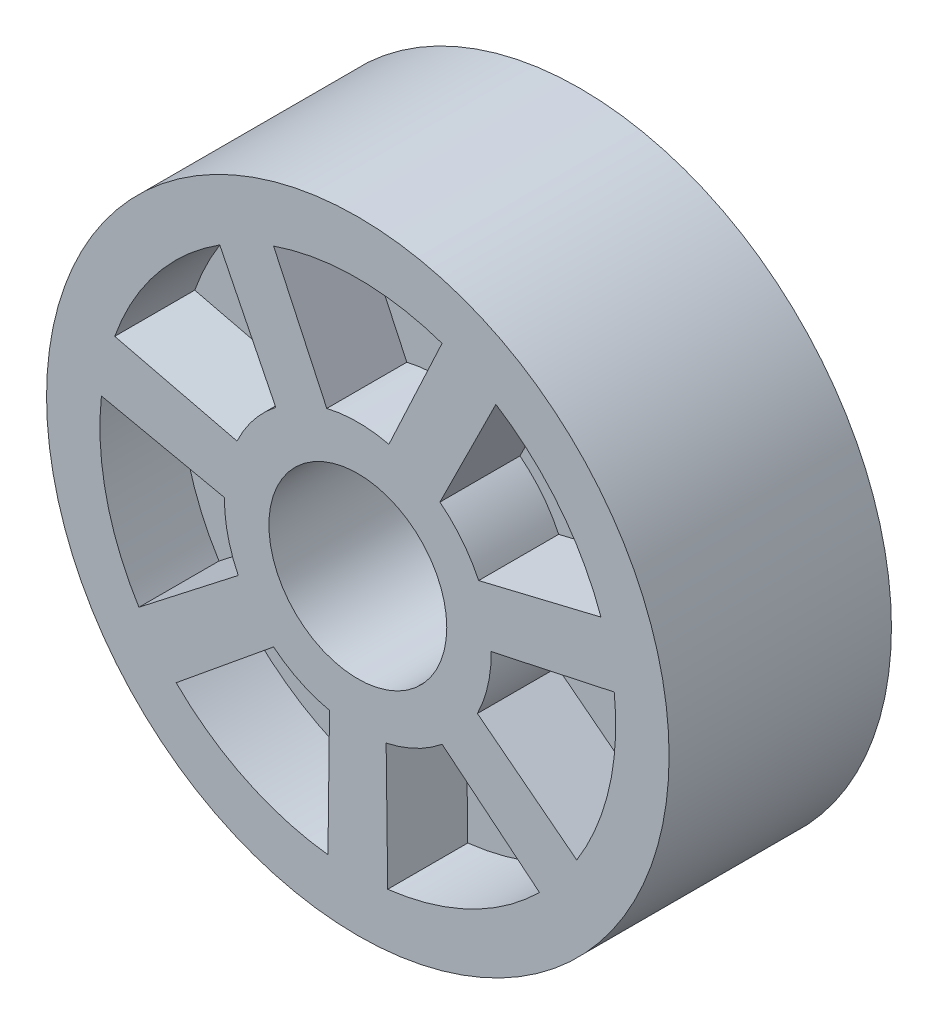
ISO-10303-21;
HEADER;
FILE_DESCRIPTION(('STEP AP214'),'2;1');
FILE_NAME('part.step','',(''),(''),'','','');
FILE_SCHEMA(('AUTOMOTIVE_DESIGN { 1 0 10303 214 1 1 1 1 }'));
ENDSEC;
DATA;
#1=APPLICATION_CONTEXT('core data for automotive mechanical design processes');
#2=APPLICATION_PROTOCOL_DEFINITION('international standard','automotive_design',2000,#1);
#3=PRODUCT_CONTEXT('',#1,'mechanical');
#4=PRODUCT('Part','Part','',(#3));
#5=PRODUCT_RELATED_PRODUCT_CATEGORY('part','',(#4));
#6=PRODUCT_DEFINITION_FORMATION('','',#4);
#7=PRODUCT_DEFINITION_CONTEXT('part definition',#1,'design');
#8=PRODUCT_DEFINITION('design','',#6,#7);
#9=PRODUCT_DEFINITION_SHAPE('','',#8);
#10=(LENGTH_UNIT() NAMED_UNIT(*) SI_UNIT(.MILLI.,.METRE.));
#11=(NAMED_UNIT(*) PLANE_ANGLE_UNIT() SI_UNIT($,.RADIAN.));
#12=(NAMED_UNIT(*) SI_UNIT($,.STERADIAN.) SOLID_ANGLE_UNIT());
#13=UNCERTAINTY_MEASURE_WITH_UNIT(LENGTH_MEASURE(1.E-05),#10,'distance_accuracy_value','');
#14=(GEOMETRIC_REPRESENTATION_CONTEXT(3) GLOBAL_UNCERTAINTY_ASSIGNED_CONTEXT((#13)) GLOBAL_UNIT_ASSIGNED_CONTEXT((#10,
#11,#12)) REPRESENTATION_CONTEXT('',''));
#15=CARTESIAN_POINT('',(0.,0.,0.));
#16=DIRECTION('',(0.,0.,1.));
#17=DIRECTION('',(1.,0.,0.));
#18=AXIS2_PLACEMENT_3D('',#15,#16,#17);
#19=CARTESIAN_POINT('',(0.,0.,12.5));
#20=DIRECTION('',(0.,0.,1.));
#21=DIRECTION('',(1.,0.,0.));
#22=AXIS2_PLACEMENT_3D('',#19,#20,#21);
#23=PLANE('',#22);
#24=CARTESIAN_POINT('',(0.,0.,12.5));
#25=DIRECTION('',(0.,0.,-1.));
#26=DIRECTION('',(0.623489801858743,0.781831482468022,0.));
#27=AXIS2_PLACEMENT_3D('',#24,#25,#26);
#28=CIRCLE('',#27,15.);
#29=CARTESIAN_POINT('',(-13.5826003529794,6.36497978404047,12.5));
#30=VERTEX_POINT('',#29);
#31=CARTESIAN_POINT('',(-9.22780936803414,11.8257149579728,12.5));
#32=VERTEX_POINT('',#31);
#33=EDGE_CURVE('E575',#30,#32,#28,.T.);
#34=ORIENTED_EDGE('',*,*,#33,.F.);
#35=DIRECTION('',(0.972078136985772,-0.234657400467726,0.));
#36=VECTOR('',#35,1.);
#37=CARTESIAN_POINT('',(-13.5826003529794,6.36497978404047,12.5));
#38=LINE('',#37,#36);
#39=CARTESIAN_POINT('',(-27.3350483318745,9.68478872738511,12.5));
#40=VERTEX_POINT('',#39);
#41=EDGE_CURVE('E586',#40,#30,#38,.T.);
#42=ORIENTED_EDGE('',*,*,#41,.F.);
#43=CARTESIAN_POINT('',(0.,0.,12.5));
#44=DIRECTION('',(0.,0.,1.));
#45=DIRECTION('',(0.623489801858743,0.781831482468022,0.));
#46=AXIS2_PLACEMENT_3D('',#43,#44,#45);
#47=CIRCLE('',#46,29.);
#48=CARTESIAN_POINT('',(-15.5245913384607,24.4946333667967,12.5));
#49=VERTEX_POINT('',#48);
#50=EDGE_CURVE('E600',#49,#40,#47,.T.);
#51=ORIENTED_EDGE('',*,*,#50,.F.);
#52=DIRECTION('',(-0.44508178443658,0.895489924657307,0.));
#53=VECTOR('',#52,1.);
#54=CARTESIAN_POINT('',(-9.22780936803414,11.8257149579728,12.5));
#55=LINE('',#54,#53);
#56=EDGE_CURVE('E597',#32,#49,#55,.T.);
#57=ORIENTED_EDGE('',*,*,#56,.F.);
#58=EDGE_LOOP('',(#34,#42,#51,#57));
#59=FACE_BOUND('',#58,.T.);
#60=CARTESIAN_POINT('',(0.,0.,12.5));
#61=DIRECTION('',(0.,0.,-1.));
#62=DIRECTION('',(-0.222520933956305,0.974927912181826,0.));
#63=AXIS2_PLACEMENT_3D('',#60,#61,#62);
#64=CIRCLE('',#63,15.);
#65=CARTESIAN_POINT('',(-13.4449543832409,-6.65080458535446,12.5));
#66=VERTEX_POINT('',#65);
#67=CARTESIAN_POINT('',(-14.999161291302,0.158620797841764,12.5));
#68=VERTEX_POINT('',#67);
#69=EDGE_CURVE('E607',#66,#68,#64,.T.);
#70=ORIENTED_EDGE('',*,*,#69,.F.);
#71=DIRECTION('',(0.789543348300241,0.613694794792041,0.));
#72=VECTOR('',#71,1.);
#73=CARTESIAN_POINT('',(-13.4449543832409,-6.65080458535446,12.5));
#74=LINE('',#73,#72);
#75=CARTESIAN_POINT('',(-24.6149965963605,-15.3330343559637,12.5));
#76=VERTEX_POINT('',#75);
#77=EDGE_CURVE('E618',#76,#66,#74,.T.);
#78=ORIENTED_EDGE('',*,*,#77,.F.);
#79=CARTESIAN_POINT('',(0.,0.,12.5));
#80=DIRECTION('',(0.,0.,1.));
#81=DIRECTION('',(-0.222520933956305,0.974927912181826,0.));
#82=AXIS2_PLACEMENT_3D('',#79,#80,#81);
#83=CIRCLE('',#82,29.);
#84=CARTESIAN_POINT('',(-28.8300998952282,3.13453984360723,12.5));
#85=VERTEX_POINT('',#84);
#86=EDGE_CURVE('E632',#85,#76,#83,.T.);
#87=ORIENTED_EDGE('',*,*,#86,.F.);
#88=DIRECTION('',(-0.977626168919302,0.210349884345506,0.));
#89=VECTOR('',#88,1.);
#90=CARTESIAN_POINT('',(-14.999161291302,0.158620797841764,12.5));
#91=LINE('',#90,#89);
#92=EDGE_CURVE('E629',#68,#85,#91,.T.);
#93=ORIENTED_EDGE('',*,*,#92,.F.);
#94=EDGE_LOOP('',(#70,#78,#87,#93));
#95=FACE_BOUND('',#94,.T.);
#96=CARTESIAN_POINT('',(0.,0.,12.5));
#97=DIRECTION('',(0.,0.,-1.));
#98=DIRECTION('',(-0.900968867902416,0.433883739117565,0.));
#99=AXIS2_PLACEMENT_3D('',#96,#97,#98);
#100=CIRCLE('',#99,15.);
#101=CARTESIAN_POINT('',(-3.18298353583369,-14.6583974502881,12.5));
#102=VERTEX_POINT('',#101);
#103=CARTESIAN_POINT('',(-9.47583883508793,-11.6279180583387,12.5));
#104=VERTEX_POINT('',#103);
#105=EDGE_CURVE('E639',#102,#104,#100,.T.);
#106=ORIENTED_EDGE('',*,*,#105,.F.);
#107=DIRECTION('',(0.0124663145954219,0.999922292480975,0.));
#108=VECTOR('',#107,1.);
#109=CARTESIAN_POINT('',(-3.18298353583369,-14.6583974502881,12.5));
#110=LINE('',#109,#108);
#111=CARTESIAN_POINT('',(-3.35935036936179,-28.804769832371,12.5));
#112=VERTEX_POINT('',#111);
#113=EDGE_CURVE('E650',#112,#102,#110,.T.);
#114=ORIENTED_EDGE('',*,*,#113,.F.);
#115=CARTESIAN_POINT('',(0.,0.,12.5));
#116=DIRECTION('',(0.,0.,1.));
#117=DIRECTION('',(-0.900968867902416,0.433883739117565,0.));
#118=AXIS2_PLACEMENT_3D('',#115,#116,#117);
#119=CIRCLE('',#118,29.);
#120=CARTESIAN_POINT('',(-20.4259552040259,-20.5859261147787,12.5));
#121=VERTEX_POINT('',#120);
#122=EDGE_CURVE('E664',#121,#112,#119,.T.);
#123=ORIENTED_EDGE('',*,*,#122,.F.);
#124=DIRECTION('',(-0.773998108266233,-0.633187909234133,0.));
#125=VECTOR('',#124,1.);
#126=CARTESIAN_POINT('',(-9.47583883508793,-11.6279180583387,12.5));
#127=LINE('',#126,#125);
#128=EDGE_CURVE('E661',#104,#121,#127,.T.);
#129=ORIENTED_EDGE('',*,*,#128,.F.);
#130=EDGE_LOOP('',(#106,#114,#123,#129));
#131=FACE_BOUND('',#130,.T.);
#132=CARTESIAN_POINT('',(0.,0.,12.5));
#133=DIRECTION('',(0.,0.,-1.));
#134=DIRECTION('',(-0.900968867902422,-0.433883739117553,0.));
#135=AXIS2_PLACEMENT_3D('',#132,#133,#134);
#136=CIRCLE('',#135,15.);
#137=CARTESIAN_POINT('',(9.47583883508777,-11.6279180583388,12.5));
#138=VERTEX_POINT('',#137);
#139=CARTESIAN_POINT('',(3.18298353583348,-14.6583974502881,12.5));
#140=VERTEX_POINT('',#139);
#141=EDGE_CURVE('E671',#138,#140,#136,.T.);
#142=ORIENTED_EDGE('',*,*,#141,.F.);
#143=DIRECTION('',(-0.773998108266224,0.633187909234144,0.));
#144=VECTOR('',#143,1.);
#145=CARTESIAN_POINT('',(9.47583883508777,-11.6279180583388,12.5));
#146=LINE('',#145,#144);
#147=CARTESIAN_POINT('',(20.4259552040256,-20.585926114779,12.5));
#148=VERTEX_POINT('',#147);
#149=EDGE_CURVE('E682',#148,#138,#146,.T.);
#150=ORIENTED_EDGE('',*,*,#149,.F.);
#151=CARTESIAN_POINT('',(0.,0.,12.5));
#152=DIRECTION('',(0.,0.,1.));
#153=DIRECTION('',(-0.900968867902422,-0.433883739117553,0.));
#154=AXIS2_PLACEMENT_3D('',#151,#152,#153);
#155=CIRCLE('',#154,29.);
#156=CARTESIAN_POINT('',(3.35935036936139,-28.804769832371,12.5));
#157=VERTEX_POINT('',#156);
#158=EDGE_CURVE('E696',#157,#148,#155,.T.);
#159=ORIENTED_EDGE('',*,*,#158,.F.);
#160=DIRECTION('',(0.0124663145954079,-0.999922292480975,0.));
#161=VECTOR('',#160,1.);
#162=CARTESIAN_POINT('',(3.18298353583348,-14.6583974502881,12.5));
#163=LINE('',#162,#161);
#164=EDGE_CURVE('E693',#140,#157,#163,.T.);
#165=ORIENTED_EDGE('',*,*,#164,.F.);
#166=EDGE_LOOP('',(#142,#150,#159,#165));
#167=FACE_BOUND('',#166,.T.);
#168=CARTESIAN_POINT('',(0.,0.,12.5));
#169=DIRECTION('',(0.,0.,-1.));
#170=DIRECTION('',(-0.222520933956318,-0.974927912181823,0.));
#171=AXIS2_PLACEMENT_3D('',#168,#169,#170);
#172=CIRCLE('',#171,15.);
#173=CARTESIAN_POINT('',(14.999161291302,0.158620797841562,12.5));
#174=VERTEX_POINT('',#173);
#175=CARTESIAN_POINT('',(13.4449543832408,-6.65080458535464,12.5));
#176=VERTEX_POINT('',#175);
#177=EDGE_CURVE('E703',#174,#176,#172,.T.);
#178=ORIENTED_EDGE('',*,*,#177,.F.);
#179=DIRECTION('',(-0.977626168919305,-0.210349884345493,0.));
#180=VECTOR('',#179,1.);
#181=CARTESIAN_POINT('',(14.999161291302,0.158620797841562,12.5));
#182=LINE('',#181,#180);
#183=CARTESIAN_POINT('',(28.8300998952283,3.13453984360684,12.5));
#184=VERTEX_POINT('',#183);
#185=EDGE_CURVE('E714',#184,#174,#182,.T.);
#186=ORIENTED_EDGE('',*,*,#185,.F.);
#187=CARTESIAN_POINT('',(0.,0.,12.5));
#188=DIRECTION('',(0.,0.,1.));
#189=DIRECTION('',(-0.222520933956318,-0.974927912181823,0.));
#190=AXIS2_PLACEMENT_3D('',#187,#188,#189);
#191=CIRCLE('',#190,29.);
#192=CARTESIAN_POINT('',(24.6149965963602,-15.333034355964,12.5));
#193=VERTEX_POINT('',#192);
#194=EDGE_CURVE('E728',#193,#184,#191,.T.);
#195=ORIENTED_EDGE('',*,*,#194,.F.);
#196=DIRECTION('',(0.789543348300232,-0.613694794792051,0.));
#197=VECTOR('',#196,1.);
#198=CARTESIAN_POINT('',(13.4449543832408,-6.65080458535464,12.5));
#199=LINE('',#198,#197);
#200=EDGE_CURVE('E725',#176,#193,#199,.T.);
#201=ORIENTED_EDGE('',*,*,#200,.F.);
#202=EDGE_LOOP('',(#178,#186,#195,#201));
#203=FACE_BOUND('',#202,.T.);
#204=CARTESIAN_POINT('',(0.,0.,12.5));
#205=DIRECTION('',(0.,0.,-1.));
#206=DIRECTION('',(0.623489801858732,-0.781831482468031,0.));
#207=AXIS2_PLACEMENT_3D('',#204,#205,#206);
#208=CIRCLE('',#207,15.);
#209=CARTESIAN_POINT('',(9.22780936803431,11.8257149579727,12.5));
#210=VERTEX_POINT('',#209);
#211=CARTESIAN_POINT('',(13.5826003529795,6.36497978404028,12.5));
#212=VERTEX_POINT('',#211);
#213=EDGE_CURVE('E735',#210,#212,#208,.T.);
#214=ORIENTED_EDGE('',*,*,#213,.F.);
#215=DIRECTION('',(-0.445081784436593,-0.895489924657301,0.));
#216=VECTOR('',#215,1.);
#217=CARTESIAN_POINT('',(9.22780936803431,11.8257149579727,12.5));
#218=LINE('',#217,#216);
#219=CARTESIAN_POINT('',(15.5245913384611,24.4946333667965,12.5));
#220=VERTEX_POINT('',#219);
#221=EDGE_CURVE('E746',#220,#210,#218,.T.);
#222=ORIENTED_EDGE('',*,*,#221,.F.);
#223=CARTESIAN_POINT('',(0.,0.,12.5));
#224=DIRECTION('',(0.,0.,1.));
#225=DIRECTION('',(0.623489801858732,-0.781831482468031,0.));
#226=AXIS2_PLACEMENT_3D('',#223,#224,#225);
#227=CIRCLE('',#226,29.);
#228=CARTESIAN_POINT('',(27.3350483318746,9.68478872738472,12.5));
#229=VERTEX_POINT('',#228);
#230=EDGE_CURVE('E760',#229,#220,#227,.T.);
#231=ORIENTED_EDGE('',*,*,#230,.F.);
#232=DIRECTION('',(0.972078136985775,0.234657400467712,0.));
#233=VECTOR('',#232,1.);
#234=CARTESIAN_POINT('',(13.5826003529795,6.36497978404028,12.5));
#235=LINE('',#234,#233);
#236=EDGE_CURVE('E757',#212,#229,#235,.T.);
#237=ORIENTED_EDGE('',*,*,#236,.F.);
#238=EDGE_LOOP('',(#214,#222,#231,#237));
#239=FACE_BOUND('',#238,.T.);
#240=CARTESIAN_POINT('',(0.,0.,12.5));
#241=DIRECTION('',(0.,0.,-1.));
#242=DIRECTION('',(1.,0.,0.));
#243=AXIS2_PLACEMENT_3D('',#240,#241,#242);
#244=CIRCLE('',#243,15.);
#245=CARTESIAN_POINT('',(-3.49227122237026,14.5878045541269,12.5));
#246=VERTEX_POINT('',#245);
#247=CARTESIAN_POINT('',(3.49227122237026,14.5878045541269,12.5));
#248=VERTEX_POINT('',#247);
#249=EDGE_CURVE('E799',#246,#248,#244,.T.);
#250=ORIENTED_EDGE('',*,*,#249,.F.);
#251=DIRECTION('',(0.4226182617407,-0.90630778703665,0.));
#252=VECTOR('',#251,1.);
#253=CARTESIAN_POINT('',(-3.49227122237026,14.5878045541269,12.5));
#254=LINE('',#253,#252);
#255=CARTESIAN_POINT('',(-9.4712511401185,27.4097683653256,12.5));
#256=VERTEX_POINT('',#255);
#257=EDGE_CURVE('E810',#256,#246,#254,.T.);
#258=ORIENTED_EDGE('',*,*,#257,.F.);
#259=CARTESIAN_POINT('',(0.,0.,12.5));
#260=DIRECTION('',(0.,0.,1.));
#261=DIRECTION('',(1.,0.,0.));
#262=AXIS2_PLACEMENT_3D('',#259,#260,#261);
#263=CIRCLE('',#262,29.);
#264=CARTESIAN_POINT('',(9.4712511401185,27.4097683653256,12.5));
#265=VERTEX_POINT('',#264);
#266=EDGE_CURVE('E824',#265,#256,#263,.T.);
#267=ORIENTED_EDGE('',*,*,#266,.F.);
#268=DIRECTION('',(0.4226182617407,0.90630778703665,0.));
#269=VECTOR('',#268,1.);
#270=CARTESIAN_POINT('',(3.49227122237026,14.5878045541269,12.5));
#271=LINE('',#270,#269);
#272=EDGE_CURVE('E821',#248,#265,#271,.T.);
#273=ORIENTED_EDGE('',*,*,#272,.F.);
#274=EDGE_LOOP('',(#250,#258,#267,#273));
#275=FACE_BOUND('',#274,.T.);
#276=CARTESIAN_POINT('',(0.,0.,12.5));
#277=DIRECTION('',(0.,0.,1.));
#278=DIRECTION('',(1.,0.,0.));
#279=AXIS2_PLACEMENT_3D('',#276,#277,#278);
#280=CIRCLE('',#279,35.);
#281=CARTESIAN_POINT('',(35.,0.,12.5));
#282=VERTEX_POINT('',#281);
#283=EDGE_CURVE('E11',#282,#282,#280,.T.);
#284=ORIENTED_EDGE('',*,*,#283,.T.);
#285=EDGE_LOOP('',(#284));
#286=FACE_BOUND('',#285,.T.);
#287=CARTESIAN_POINT('',(0.,0.,12.5));
#288=DIRECTION('',(0.,0.,1.));
#289=DIRECTION('',(1.,0.,0.));
#290=AXIS2_PLACEMENT_3D('',#287,#288,#289);
#291=CIRCLE('',#290,10.);
#292=CARTESIAN_POINT('',(10.,0.,12.5));
#293=VERTEX_POINT('',#292);
#294=EDGE_CURVE('E838',#293,#293,#291,.T.);
#295=ORIENTED_EDGE('',*,*,#294,.F.);
#296=EDGE_LOOP('',(#295));
#297=FACE_BOUND('',#296,.T.);
#298=ADVANCED_FACE('F32',(#59,#95,#131,#167,#203,#239,#275,#286,#297),#23,.T.);
#299=CARTESIAN_POINT('',(0.,0.,-12.5));
#300=DIRECTION('',(0.,0.,1.));
#301=DIRECTION('',(1.,0.,0.));
#302=AXIS2_PLACEMENT_3D('',#299,#300,#301);
#303=PLANE('',#302);
#304=DIRECTION('',(-0.972078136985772,0.234657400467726,0.));
#305=VECTOR('',#304,1.);
#306=CARTESIAN_POINT('',(-13.5826003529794,6.36497978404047,-12.5));
#307=LINE('',#306,#305);
#308=CARTESIAN_POINT('',(-13.5826003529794,6.36497978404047,-12.5));
#309=VERTEX_POINT('',#308);
#310=CARTESIAN_POINT('',(-27.3350483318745,9.68478872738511,-12.5));
#311=VERTEX_POINT('',#310);
#312=EDGE_CURVE('E414',#309,#311,#307,.T.);
#313=ORIENTED_EDGE('',*,*,#312,.F.);
#314=CARTESIAN_POINT('',(0.,0.,-12.5));
#315=DIRECTION('',(0.,0.,1.));
#316=DIRECTION('',(-0.623489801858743,-0.781831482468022,0.));
#317=AXIS2_PLACEMENT_3D('',#314,#315,#316);
#318=CIRCLE('',#317,15.);
#319=CARTESIAN_POINT('',(-9.22780936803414,11.8257149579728,-12.5));
#320=VERTEX_POINT('',#319);
#321=EDGE_CURVE('E47',#320,#309,#318,.T.);
#322=ORIENTED_EDGE('',*,*,#321,.F.);
#323=DIRECTION('',(0.445081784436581,-0.895489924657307,0.));
#324=VECTOR('',#323,1.);
#325=CARTESIAN_POINT('',(-15.5245913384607,24.4946333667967,-12.5));
#326=LINE('',#325,#324);
#327=CARTESIAN_POINT('',(-15.5245913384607,24.4946333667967,-12.5));
#328=VERTEX_POINT('',#327);
#329=EDGE_CURVE('E405',#328,#320,#326,.T.);
#330=ORIENTED_EDGE('',*,*,#329,.F.);
#331=CARTESIAN_POINT('',(0.,0.,-12.5));
#332=DIRECTION('',(0.,0.,-1.));
#333=DIRECTION('',(-0.623489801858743,-0.781831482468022,0.));
#334=AXIS2_PLACEMENT_3D('',#331,#332,#333);
#335=CIRCLE('',#334,29.);
#336=EDGE_CURVE('E408',#311,#328,#335,.T.);
#337=ORIENTED_EDGE('',*,*,#336,.F.);
#338=EDGE_LOOP('',(#313,#322,#330,#337));
#339=FACE_BOUND('',#338,.T.);
#340=DIRECTION('',(-0.789543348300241,-0.613694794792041,0.));
#341=VECTOR('',#340,1.);
#342=CARTESIAN_POINT('',(-13.4449543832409,-6.65080458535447,-12.5));
#343=LINE('',#342,#341);
#344=CARTESIAN_POINT('',(-13.4449543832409,-6.65080458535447,-12.5));
#345=VERTEX_POINT('',#344);
#346=CARTESIAN_POINT('',(-24.6149965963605,-15.3330343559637,-12.5));
#347=VERTEX_POINT('',#346);
#348=EDGE_CURVE('E438',#345,#347,#343,.T.);
#349=ORIENTED_EDGE('',*,*,#348,.F.);
#350=CARTESIAN_POINT('',(0.,0.,-12.5));
#351=DIRECTION('',(0.,0.,1.));
#352=DIRECTION('',(0.222520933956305,-0.974927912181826,0.));
#353=AXIS2_PLACEMENT_3D('',#350,#351,#352);
#354=CIRCLE('',#353,15.);
#355=CARTESIAN_POINT('',(-14.999161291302,0.158620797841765,-12.5));
#356=VERTEX_POINT('',#355);
#357=EDGE_CURVE('E55',#356,#345,#354,.T.);
#358=ORIENTED_EDGE('',*,*,#357,.F.);
#359=DIRECTION('',(0.977626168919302,-0.210349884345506,0.));
#360=VECTOR('',#359,1.);
#361=CARTESIAN_POINT('',(-28.8300998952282,3.13453984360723,-12.5));
#362=LINE('',#361,#360);
#363=CARTESIAN_POINT('',(-28.8300998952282,3.13453984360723,-12.5));
#364=VERTEX_POINT('',#363);
#365=EDGE_CURVE('E427',#364,#356,#362,.T.);
#366=ORIENTED_EDGE('',*,*,#365,.F.);
#367=CARTESIAN_POINT('',(0.,0.,-12.5));
#368=DIRECTION('',(0.,0.,-1.));
#369=DIRECTION('',(0.222520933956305,-0.974927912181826,0.));
#370=AXIS2_PLACEMENT_3D('',#367,#368,#369);
#371=CIRCLE('',#370,29.);
#372=EDGE_CURVE('E441',#347,#364,#371,.T.);
#373=ORIENTED_EDGE('',*,*,#372,.F.);
#374=EDGE_LOOP('',(#349,#358,#366,#373));
#375=FACE_BOUND('',#374,.T.);
#376=DIRECTION('',(-0.0124663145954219,-0.999922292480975,0.));
#377=VECTOR('',#376,1.);
#378=CARTESIAN_POINT('',(-3.18298353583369,-14.6583974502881,-12.5));
#379=LINE('',#378,#377);
#380=CARTESIAN_POINT('',(-3.18298353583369,-14.6583974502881,-12.5));
#381=VERTEX_POINT('',#380);
#382=CARTESIAN_POINT('',(-3.35935036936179,-28.804769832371,-12.5));
#383=VERTEX_POINT('',#382);
#384=EDGE_CURVE('E469',#381,#383,#379,.T.);
#385=ORIENTED_EDGE('',*,*,#384,.F.);
#386=CARTESIAN_POINT('',(0.,0.,-12.5));
#387=DIRECTION('',(0.,0.,1.));
#388=DIRECTION('',(0.900968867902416,-0.433883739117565,0.));
#389=AXIS2_PLACEMENT_3D('',#386,#387,#388);
#390=CIRCLE('',#389,15.);
#391=CARTESIAN_POINT('',(-9.47583883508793,-11.6279180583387,-12.5));
#392=VERTEX_POINT('',#391);
#393=EDGE_CURVE('E448',#392,#381,#390,.T.);
#394=ORIENTED_EDGE('',*,*,#393,.F.);
#395=DIRECTION('',(0.773998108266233,0.633187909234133,0.));
#396=VECTOR('',#395,1.);
#397=CARTESIAN_POINT('',(-20.4259552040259,-20.5859261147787,-12.5));
#398=LINE('',#397,#396);
#399=CARTESIAN_POINT('',(-20.4259552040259,-20.5859261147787,-12.5));
#400=VERTEX_POINT('',#399);
#401=EDGE_CURVE('E458',#400,#392,#398,.T.);
#402=ORIENTED_EDGE('',*,*,#401,.F.);
#403=CARTESIAN_POINT('',(0.,0.,-12.5));
#404=DIRECTION('',(0.,0.,-1.));
#405=DIRECTION('',(0.900968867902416,-0.433883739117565,0.));
#406=AXIS2_PLACEMENT_3D('',#403,#404,#405);
#407=CIRCLE('',#406,29.);
#408=EDGE_CURVE('E472',#383,#400,#407,.T.);
#409=ORIENTED_EDGE('',*,*,#408,.F.);
#410=EDGE_LOOP('',(#385,#394,#402,#409));
#411=FACE_BOUND('',#410,.T.);
#412=DIRECTION('',(0.773998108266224,-0.633187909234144,0.));
#413=VECTOR('',#412,1.);
#414=CARTESIAN_POINT('',(9.47583883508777,-11.6279180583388,-12.5));
#415=LINE('',#414,#413);
#416=CARTESIAN_POINT('',(9.47583883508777,-11.6279180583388,-12.5));
#417=VERTEX_POINT('',#416);
#418=CARTESIAN_POINT('',(20.4259552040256,-20.585926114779,-12.5));
#419=VERTEX_POINT('',#418);
#420=EDGE_CURVE('E501',#417,#419,#415,.T.);
#421=ORIENTED_EDGE('',*,*,#420,.F.);
#422=CARTESIAN_POINT('',(0.,0.,-12.5));
#423=DIRECTION('',(0.,0.,1.));
#424=DIRECTION('',(0.900968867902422,0.433883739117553,0.));
#425=AXIS2_PLACEMENT_3D('',#422,#423,#424);
#426=CIRCLE('',#425,15.);
#427=CARTESIAN_POINT('',(3.18298353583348,-14.6583974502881,-12.5));
#428=VERTEX_POINT('',#427);
#429=EDGE_CURVE('E479',#428,#417,#426,.T.);
#430=ORIENTED_EDGE('',*,*,#429,.F.);
#431=DIRECTION('',(-0.0124663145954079,0.999922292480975,0.));
#432=VECTOR('',#431,1.);
#433=CARTESIAN_POINT('',(3.35935036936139,-28.804769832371,-12.5));
#434=LINE('',#433,#432);
#435=CARTESIAN_POINT('',(3.35935036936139,-28.804769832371,-12.5));
#436=VERTEX_POINT('',#435);
#437=EDGE_CURVE('E490',#436,#428,#434,.T.);
#438=ORIENTED_EDGE('',*,*,#437,.F.);
#439=CARTESIAN_POINT('',(0.,0.,-12.5));
#440=DIRECTION('',(0.,0.,-1.));
#441=DIRECTION('',(0.900968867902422,0.433883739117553,0.));
#442=AXIS2_PLACEMENT_3D('',#439,#440,#441);
#443=CIRCLE('',#442,29.);
#444=EDGE_CURVE('E504',#419,#436,#443,.T.);
#445=ORIENTED_EDGE('',*,*,#444,.F.);
#446=EDGE_LOOP('',(#421,#430,#438,#445));
#447=FACE_BOUND('',#446,.T.);
#448=DIRECTION('',(0.977626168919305,0.210349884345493,0.));
#449=VECTOR('',#448,1.);
#450=CARTESIAN_POINT('',(14.999161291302,0.158620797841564,-12.5));
#451=LINE('',#450,#449);
#452=CARTESIAN_POINT('',(14.999161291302,0.158620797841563,-12.5));
#453=VERTEX_POINT('',#452);
#454=CARTESIAN_POINT('',(28.8300998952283,3.13453984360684,-12.5));
#455=VERTEX_POINT('',#454);
#456=EDGE_CURVE('E533',#453,#455,#451,.T.);
#457=ORIENTED_EDGE('',*,*,#456,.F.);
#458=CARTESIAN_POINT('',(0.,0.,-12.5));
#459=DIRECTION('',(0.,0.,1.));
#460=DIRECTION('',(0.222520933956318,0.974927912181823,0.));
#461=AXIS2_PLACEMENT_3D('',#458,#459,#460);
#462=CIRCLE('',#461,15.);
#463=CARTESIAN_POINT('',(13.4449543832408,-6.65080458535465,-12.5));
#464=VERTEX_POINT('',#463);
#465=EDGE_CURVE('E511',#464,#453,#462,.T.);
#466=ORIENTED_EDGE('',*,*,#465,.F.);
#467=DIRECTION('',(-0.789543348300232,0.613694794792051,0.));
#468=VECTOR('',#467,1.);
#469=CARTESIAN_POINT('',(24.6149965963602,-15.333034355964,-12.5));
#470=LINE('',#469,#468);
#471=CARTESIAN_POINT('',(24.6149965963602,-15.333034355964,-12.5));
#472=VERTEX_POINT('',#471);
#473=EDGE_CURVE('E522',#472,#464,#470,.T.);
#474=ORIENTED_EDGE('',*,*,#473,.F.);
#475=CARTESIAN_POINT('',(0.,0.,-12.5));
#476=DIRECTION('',(0.,0.,-1.));
#477=DIRECTION('',(0.222520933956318,0.974927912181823,0.));
#478=AXIS2_PLACEMENT_3D('',#475,#476,#477);
#479=CIRCLE('',#478,29.);
#480=EDGE_CURVE('E536',#455,#472,#479,.T.);
#481=ORIENTED_EDGE('',*,*,#480,.F.);
#482=EDGE_LOOP('',(#457,#466,#474,#481));
#483=FACE_BOUND('',#482,.T.);
#484=DIRECTION('',(0.445081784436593,0.895489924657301,0.));
#485=VECTOR('',#484,1.);
#486=CARTESIAN_POINT('',(9.22780936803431,11.8257149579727,-12.5));
#487=LINE('',#486,#485);
#488=CARTESIAN_POINT('',(9.22780936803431,11.8257149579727,-12.5));
#489=VERTEX_POINT('',#488);
#490=CARTESIAN_POINT('',(15.5245913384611,24.4946333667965,-12.5));
#491=VERTEX_POINT('',#490);
#492=EDGE_CURVE('E565',#489,#491,#487,.T.);
#493=ORIENTED_EDGE('',*,*,#492,.F.);
#494=CARTESIAN_POINT('',(0.,0.,-12.5));
#495=DIRECTION('',(0.,0.,1.));
#496=DIRECTION('',(-0.623489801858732,0.781831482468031,0.));
#497=AXIS2_PLACEMENT_3D('',#494,#495,#496);
#498=CIRCLE('',#497,15.);
#499=CARTESIAN_POINT('',(13.5826003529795,6.36497978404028,-12.5));
#500=VERTEX_POINT('',#499);
#501=EDGE_CURVE('E543',#500,#489,#498,.T.);
#502=ORIENTED_EDGE('',*,*,#501,.F.);
#503=DIRECTION('',(-0.972078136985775,-0.234657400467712,0.));
#504=VECTOR('',#503,1.);
#505=CARTESIAN_POINT('',(27.3350483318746,9.68478872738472,-12.5));
#506=LINE('',#505,#504);
#507=CARTESIAN_POINT('',(27.3350483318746,9.68478872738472,-12.5));
#508=VERTEX_POINT('',#507);
#509=EDGE_CURVE('E554',#508,#500,#506,.T.);
#510=ORIENTED_EDGE('',*,*,#509,.F.);
#511=CARTESIAN_POINT('',(0.,0.,-12.5));
#512=DIRECTION('',(0.,0.,-1.));
#513=DIRECTION('',(-0.623489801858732,0.781831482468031,0.));
#514=AXIS2_PLACEMENT_3D('',#511,#512,#513);
#515=CIRCLE('',#514,29.);
#516=EDGE_CURVE('E568',#491,#508,#515,.T.);
#517=ORIENTED_EDGE('',*,*,#516,.F.);
#518=EDGE_LOOP('',(#493,#502,#510,#517));
#519=FACE_BOUND('',#518,.T.);
#520=DIRECTION('',(-0.4226182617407,0.90630778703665,0.));
#521=VECTOR('',#520,1.);
#522=CARTESIAN_POINT('',(-3.49227122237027,14.5878045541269,-12.5));
#523=LINE('',#522,#521);
#524=CARTESIAN_POINT('',(-3.49227122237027,14.5878045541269,-12.5));
#525=VERTEX_POINT('',#524);
#526=CARTESIAN_POINT('',(-9.4712511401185,27.4097683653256,-12.5));
#527=VERTEX_POINT('',#526);
#528=EDGE_CURVE('E789',#525,#527,#523,.T.);
#529=ORIENTED_EDGE('',*,*,#528,.F.);
#530=CARTESIAN_POINT('',(0.,0.,-12.5));
#531=DIRECTION('',(0.,0.,1.));
#532=DIRECTION('',(-1.,0.,0.));
#533=AXIS2_PLACEMENT_3D('',#530,#531,#532);
#534=CIRCLE('',#533,15.);
#535=CARTESIAN_POINT('',(3.49227122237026,14.5878045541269,-12.5));
#536=VERTEX_POINT('',#535);
#537=EDGE_CURVE('E767',#536,#525,#534,.T.);
#538=ORIENTED_EDGE('',*,*,#537,.F.);
#539=DIRECTION('',(-0.4226182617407,-0.90630778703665,0.));
#540=VECTOR('',#539,1.);
#541=CARTESIAN_POINT('',(9.4712511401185,27.4097683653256,-12.5));
#542=LINE('',#541,#540);
#543=CARTESIAN_POINT('',(9.4712511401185,27.4097683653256,-12.5));
#544=VERTEX_POINT('',#543);
#545=EDGE_CURVE('E778',#544,#536,#542,.T.);
#546=ORIENTED_EDGE('',*,*,#545,.F.);
#547=CARTESIAN_POINT('',(0.,0.,-12.5));
#548=DIRECTION('',(0.,0.,-1.));
#549=DIRECTION('',(-1.,0.,0.));
#550=AXIS2_PLACEMENT_3D('',#547,#548,#549);
#551=CIRCLE('',#550,29.);
#552=EDGE_CURVE('E792',#527,#544,#551,.T.);
#553=ORIENTED_EDGE('',*,*,#552,.F.);
#554=EDGE_LOOP('',(#529,#538,#546,#553));
#555=FACE_BOUND('',#554,.T.);
#556=CARTESIAN_POINT('',(0.,0.,-12.5));
#557=DIRECTION('',(0.,0.,1.));
#558=DIRECTION('',(1.,0.,0.));
#559=AXIS2_PLACEMENT_3D('',#556,#557,#558);
#560=CIRCLE('',#559,35.);
#561=CARTESIAN_POINT('',(35.,0.,-12.5));
#562=VERTEX_POINT('',#561);
#563=EDGE_CURVE('E36',#562,#562,#560,.T.);
#564=ORIENTED_EDGE('',*,*,#563,.F.);
#565=EDGE_LOOP('',(#564));
#566=FACE_BOUND('',#565,.T.);
#567=CARTESIAN_POINT('',(0.,0.,-12.5));
#568=DIRECTION('',(0.,0.,1.));
#569=DIRECTION('',(1.,0.,0.));
#570=AXIS2_PLACEMENT_3D('',#567,#568,#569);
#571=CIRCLE('',#570,10.);
#572=CARTESIAN_POINT('',(10.,0.,-12.5));
#573=VERTEX_POINT('',#572);
#574=EDGE_CURVE('E831',#573,#573,#571,.T.);
#575=ORIENTED_EDGE('',*,*,#574,.T.);
#576=EDGE_LOOP('',(#575));
#577=FACE_BOUND('',#576,.T.);
#578=ADVANCED_FACE('F844',(#339,#375,#411,#447,#483,#519,#555,#566,#577),#303,.F.);
#579=CARTESIAN_POINT('',(0.,0.,12.5));
#580=DIRECTION('',(0.,0.,-1.));
#581=DIRECTION('',(-1.,0.,0.));
#582=AXIS2_PLACEMENT_3D('',#579,#580,#581);
#583=CYLINDRICAL_SURFACE('',#582,35.);
#584=ORIENTED_EDGE('',*,*,#283,.F.);
#585=EDGE_LOOP('',(#584));
#586=FACE_BOUND('',#585,.T.);
#587=ORIENTED_EDGE('',*,*,#563,.T.);
#588=EDGE_LOOP('',(#587));
#589=FACE_BOUND('',#588,.T.);
#590=ADVANCED_FACE('F34',(#586,#589),#583,.T.);
#591=CARTESIAN_POINT('',(0.,0.,12.5));
#592=DIRECTION('',(0.,0.,-1.));
#593=DIRECTION('',(-1.,0.,0.));
#594=AXIS2_PLACEMENT_3D('',#591,#592,#593);
#595=CYLINDRICAL_SURFACE('',#594,10.);
#596=ORIENTED_EDGE('',*,*,#294,.T.);
#597=EDGE_LOOP('',(#596));
#598=FACE_BOUND('',#597,.T.);
#599=ORIENTED_EDGE('',*,*,#574,.F.);
#600=EDGE_LOOP('',(#599));
#601=FACE_BOUND('',#600,.T.);
#602=ADVANCED_FACE('F846',(#598,#601),#595,.F.);
#603=CARTESIAN_POINT('',(0.,0.,3.50000000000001));
#604=DIRECTION('',(0.,0.,1.));
#605=DIRECTION('',(1.,0.,0.));
#606=AXIS2_PLACEMENT_3D('',#603,#604,#605);
#607=CYLINDRICAL_SURFACE('',#606,15.);
#608=ORIENTED_EDGE('',*,*,#249,.T.);
#609=DIRECTION('',(0.,0.,1.));
#610=VECTOR('',#609,1.);
#611=CARTESIAN_POINT('',(3.49227122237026,14.5878045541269,3.50000000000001));
#612=LINE('',#611,#610);
#613=CARTESIAN_POINT('',(3.49227122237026,14.5878045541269,3.50000000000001));
#614=VERTEX_POINT('',#613);
#615=EDGE_CURVE('E819',#614,#248,#612,.T.);
#616=ORIENTED_EDGE('',*,*,#615,.F.);
#617=CARTESIAN_POINT('',(0.,0.,3.50000000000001));
#618=DIRECTION('',(0.,0.,-1.));
#619=DIRECTION('',(1.,0.,0.));
#620=AXIS2_PLACEMENT_3D('',#617,#618,#619);
#621=CIRCLE('',#620,15.);
#622=CARTESIAN_POINT('',(-3.49227122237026,14.5878045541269,3.50000000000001));
#623=VERTEX_POINT('',#622);
#624=EDGE_CURVE('E806',#623,#614,#621,.T.);
#625=ORIENTED_EDGE('',*,*,#624,.F.);
#626=DIRECTION('',(0.,0.,1.));
#627=VECTOR('',#626,1.);
#628=CARTESIAN_POINT('',(-3.49227122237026,14.5878045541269,3.50000000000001));
#629=LINE('',#628,#627);
#630=EDGE_CURVE('E829',#623,#246,#629,.T.);
#631=ORIENTED_EDGE('',*,*,#630,.T.);
#632=EDGE_LOOP('',(#608,#616,#625,#631));
#633=FACE_BOUND('',#632,.T.);
#634=ADVANCED_FACE('F848',(#633),#607,.T.);
#635=CARTESIAN_POINT('',(-3.49227122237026,14.5878045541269,3.50000000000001));
#636=DIRECTION('',(-0.906307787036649,-0.4226182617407,0.));
#637=DIRECTION('',(0.4226182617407,-0.906307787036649,0.));
#638=AXIS2_PLACEMENT_3D('',#635,#636,#637);
#639=PLANE('',#638);
#640=ORIENTED_EDGE('',*,*,#257,.T.);
#641=ORIENTED_EDGE('',*,*,#630,.F.);
#642=DIRECTION('',(0.4226182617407,-0.90630778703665,0.));
#643=VECTOR('',#642,1.);
#644=CARTESIAN_POINT('',(-3.49227122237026,14.5878045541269,3.50000000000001));
#645=LINE('',#644,#643);
#646=CARTESIAN_POINT('',(-9.4712511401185,27.4097683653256,3.50000000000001));
#647=VERTEX_POINT('',#646);
#648=EDGE_CURVE('E816',#647,#623,#645,.T.);
#649=ORIENTED_EDGE('',*,*,#648,.F.);
#650=DIRECTION('',(0.,0.,1.));
#651=VECTOR('',#650,1.);
#652=CARTESIAN_POINT('',(-9.4712511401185,27.4097683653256,3.50000000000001));
#653=LINE('',#652,#651);
#654=EDGE_CURVE('E832',#647,#256,#653,.T.);
#655=ORIENTED_EDGE('',*,*,#654,.T.);
#656=EDGE_LOOP('',(#640,#641,#649,#655));
#657=FACE_BOUND('',#656,.T.);
#658=ADVANCED_FACE('F855',(#657),#639,.F.);
#659=CARTESIAN_POINT('',(0.,0.,3.50000000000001));
#660=DIRECTION('',(0.,0.,1.));
#661=DIRECTION('',(1.,0.,0.));
#662=AXIS2_PLACEMENT_3D('',#659,#660,#661);
#663=CYLINDRICAL_SURFACE('',#662,29.);
#664=ORIENTED_EDGE('',*,*,#266,.T.);
#665=ORIENTED_EDGE('',*,*,#654,.F.);
#666=CARTESIAN_POINT('',(0.,0.,3.50000000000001));
#667=DIRECTION('',(0.,0.,1.));
#668=DIRECTION('',(1.,0.,0.));
#669=AXIS2_PLACEMENT_3D('',#666,#667,#668);
#670=CIRCLE('',#669,29.);
#671=CARTESIAN_POINT('',(9.4712511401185,27.4097683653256,3.50000000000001));
#672=VERTEX_POINT('',#671);
#673=EDGE_CURVE('E813',#672,#647,#670,.T.);
#674=ORIENTED_EDGE('',*,*,#673,.F.);
#675=DIRECTION('',(0.,0.,1.));
#676=VECTOR('',#675,1.);
#677=CARTESIAN_POINT('',(9.4712511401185,27.4097683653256,3.50000000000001));
#678=LINE('',#677,#676);
#679=EDGE_CURVE('E834',#672,#265,#678,.T.);
#680=ORIENTED_EDGE('',*,*,#679,.T.);
#681=EDGE_LOOP('',(#664,#665,#674,#680));
#682=FACE_BOUND('',#681,.T.);
#683=ADVANCED_FACE('F912',(#682),#663,.F.);
#684=CARTESIAN_POINT('',(3.49227122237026,14.5878045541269,3.50000000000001));
#685=DIRECTION('',(0.906307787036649,-0.4226182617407,0.));
#686=DIRECTION('',(0.4226182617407,0.906307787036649,0.));
#687=AXIS2_PLACEMENT_3D('',#684,#685,#686);
#688=PLANE('',#687);
#689=ORIENTED_EDGE('',*,*,#272,.T.);
#690=ORIENTED_EDGE('',*,*,#679,.F.);
#691=DIRECTION('',(0.4226182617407,0.90630778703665,0.));
#692=VECTOR('',#691,1.);
#693=CARTESIAN_POINT('',(3.49227122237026,14.5878045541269,3.50000000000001));
#694=LINE('',#693,#692);
#695=EDGE_CURVE('E809',#614,#672,#694,.T.);
#696=ORIENTED_EDGE('',*,*,#695,.F.);
#697=ORIENTED_EDGE('',*,*,#615,.T.);
#698=EDGE_LOOP('',(#689,#690,#696,#697));
#699=FACE_BOUND('',#698,.T.);
#700=ADVANCED_FACE('F905',(#699),#688,.F.);
#701=CARTESIAN_POINT('',(0.,0.,3.50000000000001));
#702=DIRECTION('',(0.,0.,1.));
#703=DIRECTION('',(1.,0.,0.));
#704=AXIS2_PLACEMENT_3D('',#701,#702,#703);
#705=PLANE('',#704);
#706=ORIENTED_EDGE('',*,*,#624,.T.);
#707=ORIENTED_EDGE('',*,*,#695,.T.);
#708=ORIENTED_EDGE('',*,*,#673,.T.);
#709=ORIENTED_EDGE('',*,*,#648,.T.);
#710=EDGE_LOOP('',(#706,#707,#708,#709));
#711=FACE_BOUND('',#710,.T.);
#712=ADVANCED_FACE('F908',(#711),#705,.T.);
#713=CARTESIAN_POINT('',(0.,0.,-3.50000000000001));
#714=DIRECTION('',(0.,0.,-1.));
#715=DIRECTION('',(-1.,0.,0.));
#716=AXIS2_PLACEMENT_3D('',#713,#714,#715);
#717=CYLINDRICAL_SURFACE('',#716,15.);
#718=ORIENTED_EDGE('',*,*,#537,.T.);
#719=DIRECTION('',(0.,0.,-1.));
#720=VECTOR('',#719,1.);
#721=CARTESIAN_POINT('',(-3.49227122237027,14.5878045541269,-3.50000000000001));
#722=LINE('',#721,#720);
#723=CARTESIAN_POINT('',(-3.49227122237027,14.5878045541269,-3.50000000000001));
#724=VERTEX_POINT('',#723);
#725=EDGE_CURVE('E787',#724,#525,#722,.T.);
#726=ORIENTED_EDGE('',*,*,#725,.F.);
#727=CARTESIAN_POINT('',(0.,0.,-3.50000000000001));
#728=DIRECTION('',(0.,0.,1.));
#729=DIRECTION('',(-1.,0.,0.));
#730=AXIS2_PLACEMENT_3D('',#727,#728,#729);
#731=CIRCLE('',#730,15.);
#732=CARTESIAN_POINT('',(3.49227122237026,14.5878045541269,-3.50000000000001));
#733=VERTEX_POINT('',#732);
#734=EDGE_CURVE('E774',#733,#724,#731,.T.);
#735=ORIENTED_EDGE('',*,*,#734,.F.);
#736=DIRECTION('',(0.,0.,-1.));
#737=VECTOR('',#736,1.);
#738=CARTESIAN_POINT('',(3.49227122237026,14.5878045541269,-3.50000000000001));
#739=LINE('',#738,#737);
#740=EDGE_CURVE('E797',#733,#536,#739,.T.);
#741=ORIENTED_EDGE('',*,*,#740,.T.);
#742=EDGE_LOOP('',(#718,#726,#735,#741));
#743=FACE_BOUND('',#742,.T.);
#744=ADVANCED_FACE('F924',(#743),#717,.T.);
#745=CARTESIAN_POINT('',(9.4712511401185,27.4097683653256,-3.50000000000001));
#746=DIRECTION('',(0.906307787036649,-0.4226182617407,0.));
#747=DIRECTION('',(0.4226182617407,0.906307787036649,0.));
#748=AXIS2_PLACEMENT_3D('',#745,#746,#747);
#749=PLANE('',#748);
#750=ORIENTED_EDGE('',*,*,#545,.T.);
#751=ORIENTED_EDGE('',*,*,#740,.F.);
#752=DIRECTION('',(-0.4226182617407,-0.90630778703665,0.));
#753=VECTOR('',#752,1.);
#754=CARTESIAN_POINT('',(9.4712511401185,27.4097683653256,-3.50000000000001));
#755=LINE('',#754,#753);
#756=CARTESIAN_POINT('',(9.4712511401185,27.4097683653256,-3.50000000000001));
#757=VERTEX_POINT('',#756);
#758=EDGE_CURVE('E784',#757,#733,#755,.T.);
#759=ORIENTED_EDGE('',*,*,#758,.F.);
#760=DIRECTION('',(0.,0.,-1.));
#761=VECTOR('',#760,1.);
#762=CARTESIAN_POINT('',(9.4712511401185,27.4097683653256,-3.50000000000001));
#763=LINE('',#762,#761);
#764=EDGE_CURVE('E800',#757,#544,#763,.T.);
#765=ORIENTED_EDGE('',*,*,#764,.T.);
#766=EDGE_LOOP('',(#750,#751,#759,#765));
#767=FACE_BOUND('',#766,.T.);
#768=ADVANCED_FACE('F927',(#767),#749,.F.);
#769=CARTESIAN_POINT('',(0.,0.,-3.50000000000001));
#770=DIRECTION('',(0.,0.,-1.));
#771=DIRECTION('',(-1.,0.,0.));
#772=AXIS2_PLACEMENT_3D('',#769,#770,#771);
#773=CYLINDRICAL_SURFACE('',#772,29.);
#774=ORIENTED_EDGE('',*,*,#552,.T.);
#775=ORIENTED_EDGE('',*,*,#764,.F.);
#776=CARTESIAN_POINT('',(0.,0.,-3.50000000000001));
#777=DIRECTION('',(0.,0.,-1.));
#778=DIRECTION('',(-1.,0.,0.));
#779=AXIS2_PLACEMENT_3D('',#776,#777,#778);
#780=CIRCLE('',#779,29.);
#781=CARTESIAN_POINT('',(-9.4712511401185,27.4097683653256,-3.50000000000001));
#782=VERTEX_POINT('',#781);
#783=EDGE_CURVE('E781',#782,#757,#780,.T.);
#784=ORIENTED_EDGE('',*,*,#783,.F.);
#785=DIRECTION('',(0.,0.,-1.));
#786=VECTOR('',#785,1.);
#787=CARTESIAN_POINT('',(-9.4712511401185,27.4097683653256,-3.50000000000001));
#788=LINE('',#787,#786);
#789=EDGE_CURVE('E802',#782,#527,#788,.T.);
#790=ORIENTED_EDGE('',*,*,#789,.T.);
#791=EDGE_LOOP('',(#774,#775,#784,#790));
#792=FACE_BOUND('',#791,.T.);
#793=ADVANCED_FACE('F933',(#792),#773,.F.);
#794=CARTESIAN_POINT('',(-3.49227122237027,14.5878045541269,-3.50000000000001));
#795=DIRECTION('',(-0.906307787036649,-0.4226182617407,0.));
#796=DIRECTION('',(0.4226182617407,-0.906307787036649,0.));
#797=AXIS2_PLACEMENT_3D('',#794,#795,#796);
#798=PLANE('',#797);
#799=ORIENTED_EDGE('',*,*,#528,.T.);
#800=ORIENTED_EDGE('',*,*,#789,.F.);
#801=DIRECTION('',(-0.4226182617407,0.90630778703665,0.));
#802=VECTOR('',#801,1.);
#803=CARTESIAN_POINT('',(-3.49227122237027,14.5878045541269,-3.50000000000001));
#804=LINE('',#803,#802);
#805=EDGE_CURVE('E777',#724,#782,#804,.T.);
#806=ORIENTED_EDGE('',*,*,#805,.F.);
#807=ORIENTED_EDGE('',*,*,#725,.T.);
#808=EDGE_LOOP('',(#799,#800,#806,#807));
#809=FACE_BOUND('',#808,.T.);
#810=ADVANCED_FACE('F929',(#809),#798,.F.);
#811=CARTESIAN_POINT('',(0.,0.,-3.50000000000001));
#812=DIRECTION('',(0.,0.,-1.));
#813=DIRECTION('',(-1.,0.,0.));
#814=AXIS2_PLACEMENT_3D('',#811,#812,#813);
#815=PLANE('',#814);
#816=ORIENTED_EDGE('',*,*,#734,.T.);
#817=ORIENTED_EDGE('',*,*,#805,.T.);
#818=ORIENTED_EDGE('',*,*,#783,.T.);
#819=ORIENTED_EDGE('',*,*,#758,.T.);
#820=EDGE_LOOP('',(#816,#817,#818,#819));
#821=FACE_BOUND('',#820,.T.);
#822=ADVANCED_FACE('F932',(#821),#815,.T.);
#823=CARTESIAN_POINT('',(0.,0.,3.50000000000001));
#824=DIRECTION('',(0.,0.,1.));
#825=DIRECTION('',(1.,0.,0.));
#826=AXIS2_PLACEMENT_3D('',#823,#824,#825);
#827=CYLINDRICAL_SURFACE('',#826,15.);
#828=ORIENTED_EDGE('',*,*,#213,.T.);
#829=DIRECTION('',(0.,0.,1.));
#830=VECTOR('',#829,1.);
#831=CARTESIAN_POINT('',(13.5826003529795,6.36497978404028,3.50000000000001));
#832=LINE('',#831,#830);
#833=CARTESIAN_POINT('',(13.5826003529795,6.36497978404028,3.50000000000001));
#834=VERTEX_POINT('',#833);
#835=EDGE_CURVE('E755',#834,#212,#832,.T.);
#836=ORIENTED_EDGE('',*,*,#835,.F.);
#837=CARTESIAN_POINT('',(0.,0.,3.50000000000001));
#838=DIRECTION('',(0.,0.,-1.));
#839=DIRECTION('',(0.623489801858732,-0.781831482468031,0.));
#840=AXIS2_PLACEMENT_3D('',#837,#838,#839);
#841=CIRCLE('',#840,15.);
#842=CARTESIAN_POINT('',(9.22780936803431,11.8257149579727,3.50000000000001));
#843=VERTEX_POINT('',#842);
#844=EDGE_CURVE('E742',#843,#834,#841,.T.);
#845=ORIENTED_EDGE('',*,*,#844,.F.);
#846=DIRECTION('',(0.,0.,1.));
#847=VECTOR('',#846,1.);
#848=CARTESIAN_POINT('',(9.22780936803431,11.8257149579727,3.50000000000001));
#849=LINE('',#848,#847);
#850=EDGE_CURVE('E765',#843,#210,#849,.T.);
#851=ORIENTED_EDGE('',*,*,#850,.T.);
#852=EDGE_LOOP('',(#828,#836,#845,#851));
#853=FACE_BOUND('',#852,.T.);
#854=ADVANCED_FACE('F943',(#853),#827,.T.);
#855=CARTESIAN_POINT('',(9.22780936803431,11.8257149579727,3.50000000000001));
#856=DIRECTION('',(-0.895489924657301,0.445081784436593,0.));
#857=DIRECTION('',(-0.445081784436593,-0.895489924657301,0.));
#858=AXIS2_PLACEMENT_3D('',#855,#856,#857);
#859=PLANE('',#858);
#860=ORIENTED_EDGE('',*,*,#221,.T.);
#861=ORIENTED_EDGE('',*,*,#850,.F.);
#862=DIRECTION('',(-0.445081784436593,-0.895489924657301,0.));
#863=VECTOR('',#862,1.);
#864=CARTESIAN_POINT('',(9.22780936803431,11.8257149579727,3.50000000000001));
#865=LINE('',#864,#863);
#866=CARTESIAN_POINT('',(15.5245913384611,24.4946333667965,3.50000000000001));
#867=VERTEX_POINT('',#866);
#868=EDGE_CURVE('E752',#867,#843,#865,.T.);
#869=ORIENTED_EDGE('',*,*,#868,.F.);
#870=DIRECTION('',(0.,0.,1.));
#871=VECTOR('',#870,1.);
#872=CARTESIAN_POINT('',(15.5245913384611,24.4946333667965,3.50000000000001));
#873=LINE('',#872,#871);
#874=EDGE_CURVE('E768',#867,#220,#873,.T.);
#875=ORIENTED_EDGE('',*,*,#874,.T.);
#876=EDGE_LOOP('',(#860,#861,#869,#875));
#877=FACE_BOUND('',#876,.T.);
#878=ADVANCED_FACE('F947',(#877),#859,.F.);
#879=CARTESIAN_POINT('',(0.,0.,3.50000000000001));
#880=DIRECTION('',(0.,0.,1.));
#881=DIRECTION('',(1.,0.,0.));
#882=AXIS2_PLACEMENT_3D('',#879,#880,#881);
#883=CYLINDRICAL_SURFACE('',#882,29.);
#884=ORIENTED_EDGE('',*,*,#230,.T.);
#885=ORIENTED_EDGE('',*,*,#874,.F.);
#886=CARTESIAN_POINT('',(0.,0.,3.50000000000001));
#887=DIRECTION('',(0.,0.,1.));
#888=DIRECTION('',(0.623489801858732,-0.781831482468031,0.));
#889=AXIS2_PLACEMENT_3D('',#886,#887,#888);
#890=CIRCLE('',#889,29.);
#891=CARTESIAN_POINT('',(27.3350483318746,9.68478872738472,3.50000000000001));
#892=VERTEX_POINT('',#891);
#893=EDGE_CURVE('E749',#892,#867,#890,.T.);
#894=ORIENTED_EDGE('',*,*,#893,.F.);
#895=DIRECTION('',(0.,0.,1.));
#896=VECTOR('',#895,1.);
#897=CARTESIAN_POINT('',(27.3350483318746,9.68478872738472,3.50000000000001));
#898=LINE('',#897,#896);
#899=EDGE_CURVE('E770',#892,#229,#898,.T.);
#900=ORIENTED_EDGE('',*,*,#899,.T.);
#901=EDGE_LOOP('',(#884,#885,#894,#900));
#902=FACE_BOUND('',#901,.T.);
#903=ADVANCED_FACE('F953',(#902),#883,.F.);
#904=CARTESIAN_POINT('',(13.5826003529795,6.36497978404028,3.50000000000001));
#905=DIRECTION('',(0.234657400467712,-0.972078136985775,0.));
#906=DIRECTION('',(0.972078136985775,0.234657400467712,0.));
#907=AXIS2_PLACEMENT_3D('',#904,#905,#906);
#908=PLANE('',#907);
#909=ORIENTED_EDGE('',*,*,#236,.T.);
#910=ORIENTED_EDGE('',*,*,#899,.F.);
#911=DIRECTION('',(0.972078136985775,0.234657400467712,0.));
#912=VECTOR('',#911,1.);
#913=CARTESIAN_POINT('',(13.5826003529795,6.36497978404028,3.50000000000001));
#914=LINE('',#913,#912);
#915=EDGE_CURVE('E745',#834,#892,#914,.T.);
#916=ORIENTED_EDGE('',*,*,#915,.F.);
#917=ORIENTED_EDGE('',*,*,#835,.T.);
#918=EDGE_LOOP('',(#909,#910,#916,#917));
#919=FACE_BOUND('',#918,.T.);
#920=ADVANCED_FACE('F949',(#919),#908,.F.);
#921=CARTESIAN_POINT('',(0.,0.,3.50000000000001));
#922=DIRECTION('',(0.,0.,1.));
#923=DIRECTION('',(0.623489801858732,-0.781831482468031,0.));
#924=AXIS2_PLACEMENT_3D('',#921,#922,#923);
#925=PLANE('',#924);
#926=ORIENTED_EDGE('',*,*,#844,.T.);
#927=ORIENTED_EDGE('',*,*,#915,.T.);
#928=ORIENTED_EDGE('',*,*,#893,.T.);
#929=ORIENTED_EDGE('',*,*,#868,.T.);
#930=EDGE_LOOP('',(#926,#927,#928,#929));
#931=FACE_BOUND('',#930,.T.);
#932=ADVANCED_FACE('F952',(#931),#925,.T.);
#933=CARTESIAN_POINT('',(0.,0.,3.50000000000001));
#934=DIRECTION('',(0.,0.,1.));
#935=DIRECTION('',(1.,0.,0.));
#936=AXIS2_PLACEMENT_3D('',#933,#934,#935);
#937=CYLINDRICAL_SURFACE('',#936,15.);
#938=ORIENTED_EDGE('',*,*,#177,.T.);
#939=DIRECTION('',(0.,0.,1.));
#940=VECTOR('',#939,1.);
#941=CARTESIAN_POINT('',(13.4449543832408,-6.65080458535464,3.50000000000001));
#942=LINE('',#941,#940);
#943=CARTESIAN_POINT('',(13.4449543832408,-6.65080458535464,3.50000000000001));
#944=VERTEX_POINT('',#943);
#945=EDGE_CURVE('E723',#944,#176,#942,.T.);
#946=ORIENTED_EDGE('',*,*,#945,.F.);
#947=CARTESIAN_POINT('',(0.,0.,3.50000000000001));
#948=DIRECTION('',(0.,0.,-1.));
#949=DIRECTION('',(-0.222520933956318,-0.974927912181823,0.));
#950=AXIS2_PLACEMENT_3D('',#947,#948,#949);
#951=CIRCLE('',#950,15.);
#952=CARTESIAN_POINT('',(14.999161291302,0.158620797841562,3.50000000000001));
#953=VERTEX_POINT('',#952);
#954=EDGE_CURVE('E710',#953,#944,#951,.T.);
#955=ORIENTED_EDGE('',*,*,#954,.F.);
#956=DIRECTION('',(0.,0.,1.));
#957=VECTOR('',#956,1.);
#958=CARTESIAN_POINT('',(14.999161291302,0.158620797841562,3.50000000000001));
#959=LINE('',#958,#957);
#960=EDGE_CURVE('E733',#953,#174,#959,.T.);
#961=ORIENTED_EDGE('',*,*,#960,.T.);
#962=EDGE_LOOP('',(#938,#946,#955,#961));
#963=FACE_BOUND('',#962,.T.);
#964=ADVANCED_FACE('F963',(#963),#937,.T.);
#965=CARTESIAN_POINT('',(14.999161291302,0.158620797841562,3.50000000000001));
#966=DIRECTION('',(-0.210349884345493,0.977626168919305,0.));
#967=DIRECTION('',(-0.977626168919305,-0.210349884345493,0.));
#968=AXIS2_PLACEMENT_3D('',#965,#966,#967);
#969=PLANE('',#968);
#970=ORIENTED_EDGE('',*,*,#185,.T.);
#971=ORIENTED_EDGE('',*,*,#960,.F.);
#972=DIRECTION('',(-0.977626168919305,-0.210349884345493,0.));
#973=VECTOR('',#972,1.);
#974=CARTESIAN_POINT('',(14.999161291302,0.158620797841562,3.50000000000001));
#975=LINE('',#974,#973);
#976=CARTESIAN_POINT('',(28.8300998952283,3.13453984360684,3.50000000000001));
#977=VERTEX_POINT('',#976);
#978=EDGE_CURVE('E720',#977,#953,#975,.T.);
#979=ORIENTED_EDGE('',*,*,#978,.F.);
#980=DIRECTION('',(0.,0.,1.));
#981=VECTOR('',#980,1.);
#982=CARTESIAN_POINT('',(28.8300998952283,3.13453984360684,3.50000000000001));
#983=LINE('',#982,#981);
#984=EDGE_CURVE('E736',#977,#184,#983,.T.);
#985=ORIENTED_EDGE('',*,*,#984,.T.);
#986=EDGE_LOOP('',(#970,#971,#979,#985));
#987=FACE_BOUND('',#986,.T.);
#988=ADVANCED_FACE('F967',(#987),#969,.F.);
#989=CARTESIAN_POINT('',(0.,0.,3.50000000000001));
#990=DIRECTION('',(0.,0.,1.));
#991=DIRECTION('',(1.,0.,0.));
#992=AXIS2_PLACEMENT_3D('',#989,#990,#991);
#993=CYLINDRICAL_SURFACE('',#992,29.);
#994=ORIENTED_EDGE('',*,*,#194,.T.);
#995=ORIENTED_EDGE('',*,*,#984,.F.);
#996=CARTESIAN_POINT('',(0.,0.,3.50000000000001));
#997=DIRECTION('',(0.,0.,1.));
#998=DIRECTION('',(-0.222520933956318,-0.974927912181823,0.));
#999=AXIS2_PLACEMENT_3D('',#996,#997,#998);
#1000=CIRCLE('',#999,29.);
#1001=CARTESIAN_POINT('',(24.6149965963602,-15.333034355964,3.50000000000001));
#1002=VERTEX_POINT('',#1001);
#1003=EDGE_CURVE('E717',#1002,#977,#1000,.T.);
#1004=ORIENTED_EDGE('',*,*,#1003,.F.);
#1005=DIRECTION('',(0.,0.,1.));
#1006=VECTOR('',#1005,1.);
#1007=CARTESIAN_POINT('',(24.6149965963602,-15.333034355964,3.50000000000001));
#1008=LINE('',#1007,#1006);
#1009=EDGE_CURVE('E738',#1002,#193,#1008,.T.);
#1010=ORIENTED_EDGE('',*,*,#1009,.T.);
#1011=EDGE_LOOP('',(#994,#995,#1004,#1010));
#1012=FACE_BOUND('',#1011,.T.);
#1013=ADVANCED_FACE('F973',(#1012),#993,.F.);
#1014=CARTESIAN_POINT('',(13.4449543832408,-6.65080458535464,3.50000000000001));
#1015=DIRECTION('',(-0.613694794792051,-0.789543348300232,0.));
#1016=DIRECTION('',(0.789543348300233,-0.613694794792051,0.));
#1017=AXIS2_PLACEMENT_3D('',#1014,#1015,#1016);
#1018=PLANE('',#1017);
#1019=ORIENTED_EDGE('',*,*,#200,.T.);
#1020=ORIENTED_EDGE('',*,*,#1009,.F.);
#1021=DIRECTION('',(0.789543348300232,-0.613694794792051,0.));
#1022=VECTOR('',#1021,1.);
#1023=CARTESIAN_POINT('',(13.4449543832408,-6.65080458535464,3.50000000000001));
#1024=LINE('',#1023,#1022);
#1025=EDGE_CURVE('E713',#944,#1002,#1024,.T.);
#1026=ORIENTED_EDGE('',*,*,#1025,.F.);
#1027=ORIENTED_EDGE('',*,*,#945,.T.);
#1028=EDGE_LOOP('',(#1019,#1020,#1026,#1027));
#1029=FACE_BOUND('',#1028,.T.);
#1030=ADVANCED_FACE('F969',(#1029),#1018,.F.);
#1031=CARTESIAN_POINT('',(0.,0.,3.50000000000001));
#1032=DIRECTION('',(0.,0.,1.));
#1033=DIRECTION('',(-0.222520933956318,-0.974927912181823,0.));
#1034=AXIS2_PLACEMENT_3D('',#1031,#1032,#1033);
#1035=PLANE('',#1034);
#1036=ORIENTED_EDGE('',*,*,#954,.T.);
#1037=ORIENTED_EDGE('',*,*,#1025,.T.);
#1038=ORIENTED_EDGE('',*,*,#1003,.T.);
#1039=ORIENTED_EDGE('',*,*,#978,.T.);
#1040=EDGE_LOOP('',(#1036,#1037,#1038,#1039));
#1041=FACE_BOUND('',#1040,.T.);
#1042=ADVANCED_FACE('F972',(#1041),#1035,.T.);
#1043=CARTESIAN_POINT('',(0.,0.,3.50000000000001));
#1044=DIRECTION('',(0.,0.,1.));
#1045=DIRECTION('',(1.,0.,0.));
#1046=AXIS2_PLACEMENT_3D('',#1043,#1044,#1045);
#1047=CYLINDRICAL_SURFACE('',#1046,15.);
#1048=ORIENTED_EDGE('',*,*,#141,.T.);
#1049=DIRECTION('',(0.,0.,1.));
#1050=VECTOR('',#1049,1.);
#1051=CARTESIAN_POINT('',(3.18298353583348,-14.6583974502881,3.50000000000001));
#1052=LINE('',#1051,#1050);
#1053=CARTESIAN_POINT('',(3.18298353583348,-14.6583974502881,3.50000000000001));
#1054=VERTEX_POINT('',#1053);
#1055=EDGE_CURVE('E691',#1054,#140,#1052,.T.);
#1056=ORIENTED_EDGE('',*,*,#1055,.F.);
#1057=CARTESIAN_POINT('',(0.,0.,3.50000000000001));
#1058=DIRECTION('',(0.,0.,-1.));
#1059=DIRECTION('',(-0.900968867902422,-0.433883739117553,0.));
#1060=AXIS2_PLACEMENT_3D('',#1057,#1058,#1059);
#1061=CIRCLE('',#1060,15.);
#1062=CARTESIAN_POINT('',(9.47583883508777,-11.6279180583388,3.50000000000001));
#1063=VERTEX_POINT('',#1062);
#1064=EDGE_CURVE('E678',#1063,#1054,#1061,.T.);
#1065=ORIENTED_EDGE('',*,*,#1064,.F.);
#1066=DIRECTION('',(0.,0.,1.));
#1067=VECTOR('',#1066,1.);
#1068=CARTESIAN_POINT('',(9.47583883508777,-11.6279180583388,3.50000000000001));
#1069=LINE('',#1068,#1067);
#1070=EDGE_CURVE('E701',#1063,#138,#1069,.T.);
#1071=ORIENTED_EDGE('',*,*,#1070,.T.);
#1072=EDGE_LOOP('',(#1048,#1056,#1065,#1071));
#1073=FACE_BOUND('',#1072,.T.);
#1074=ADVANCED_FACE('F983',(#1073),#1047,.T.);
#1075=CARTESIAN_POINT('',(9.47583883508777,-11.6279180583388,3.50000000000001));
#1076=DIRECTION('',(0.633187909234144,0.773998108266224,0.));
#1077=DIRECTION('',(-0.773998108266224,0.633187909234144,0.));
#1078=AXIS2_PLACEMENT_3D('',#1075,#1076,#1077);
#1079=PLANE('',#1078);
#1080=ORIENTED_EDGE('',*,*,#149,.T.);
#1081=ORIENTED_EDGE('',*,*,#1070,.F.);
#1082=DIRECTION('',(-0.773998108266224,0.633187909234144,0.));
#1083=VECTOR('',#1082,1.);
#1084=CARTESIAN_POINT('',(9.47583883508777,-11.6279180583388,3.50000000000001));
#1085=LINE('',#1084,#1083);
#1086=CARTESIAN_POINT('',(20.4259552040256,-20.585926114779,3.50000000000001));
#1087=VERTEX_POINT('',#1086);
#1088=EDGE_CURVE('E688',#1087,#1063,#1085,.T.);
#1089=ORIENTED_EDGE('',*,*,#1088,.F.);
#1090=DIRECTION('',(0.,0.,1.));
#1091=VECTOR('',#1090,1.);
#1092=CARTESIAN_POINT('',(20.4259552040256,-20.585926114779,3.50000000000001));
#1093=LINE('',#1092,#1091);
#1094=EDGE_CURVE('E704',#1087,#148,#1093,.T.);
#1095=ORIENTED_EDGE('',*,*,#1094,.T.);
#1096=EDGE_LOOP('',(#1080,#1081,#1089,#1095));
#1097=FACE_BOUND('',#1096,.T.);
#1098=ADVANCED_FACE('F987',(#1097),#1079,.F.);
#1099=CARTESIAN_POINT('',(0.,0.,3.50000000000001));
#1100=DIRECTION('',(0.,0.,1.));
#1101=DIRECTION('',(1.,0.,0.));
#1102=AXIS2_PLACEMENT_3D('',#1099,#1100,#1101);
#1103=CYLINDRICAL_SURFACE('',#1102,29.);
#1104=ORIENTED_EDGE('',*,*,#158,.T.);
#1105=ORIENTED_EDGE('',*,*,#1094,.F.);
#1106=CARTESIAN_POINT('',(0.,0.,3.50000000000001));
#1107=DIRECTION('',(0.,0.,1.));
#1108=DIRECTION('',(-0.900968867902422,-0.433883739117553,0.));
#1109=AXIS2_PLACEMENT_3D('',#1106,#1107,#1108);
#1110=CIRCLE('',#1109,29.);
#1111=CARTESIAN_POINT('',(3.35935036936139,-28.804769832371,3.50000000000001));
#1112=VERTEX_POINT('',#1111);
#1113=EDGE_CURVE('E685',#1112,#1087,#1110,.T.);
#1114=ORIENTED_EDGE('',*,*,#1113,.F.);
#1115=DIRECTION('',(0.,0.,1.));
#1116=VECTOR('',#1115,1.);
#1117=CARTESIAN_POINT('',(3.35935036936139,-28.804769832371,3.50000000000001));
#1118=LINE('',#1117,#1116);
#1119=EDGE_CURVE('E706',#1112,#157,#1118,.T.);
#1120=ORIENTED_EDGE('',*,*,#1119,.T.);
#1121=EDGE_LOOP('',(#1104,#1105,#1114,#1120));
#1122=FACE_BOUND('',#1121,.T.);
#1123=ADVANCED_FACE('F993',(#1122),#1103,.F.);
#1124=CARTESIAN_POINT('',(3.18298353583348,-14.6583974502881,3.50000000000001));
#1125=DIRECTION('',(-0.999922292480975,-0.0124663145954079,0.));
#1126=DIRECTION('',(0.0124663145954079,-0.999922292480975,0.));
#1127=AXIS2_PLACEMENT_3D('',#1124,#1125,#1126);
#1128=PLANE('',#1127);
#1129=ORIENTED_EDGE('',*,*,#164,.T.);
#1130=ORIENTED_EDGE('',*,*,#1119,.F.);
#1131=DIRECTION('',(0.0124663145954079,-0.999922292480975,0.));
#1132=VECTOR('',#1131,1.);
#1133=CARTESIAN_POINT('',(3.18298353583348,-14.6583974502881,3.50000000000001));
#1134=LINE('',#1133,#1132);
#1135=EDGE_CURVE('E681',#1054,#1112,#1134,.T.);
#1136=ORIENTED_EDGE('',*,*,#1135,.F.);
#1137=ORIENTED_EDGE('',*,*,#1055,.T.);
#1138=EDGE_LOOP('',(#1129,#1130,#1136,#1137));
#1139=FACE_BOUND('',#1138,.T.);
#1140=ADVANCED_FACE('F989',(#1139),#1128,.F.);
#1141=CARTESIAN_POINT('',(0.,0.,3.50000000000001));
#1142=DIRECTION('',(0.,0.,1.));
#1143=DIRECTION('',(-0.900968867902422,-0.433883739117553,0.));
#1144=AXIS2_PLACEMENT_3D('',#1141,#1142,#1143);
#1145=PLANE('',#1144);
#1146=ORIENTED_EDGE('',*,*,#1064,.T.);
#1147=ORIENTED_EDGE('',*,*,#1135,.T.);
#1148=ORIENTED_EDGE('',*,*,#1113,.T.);
#1149=ORIENTED_EDGE('',*,*,#1088,.T.);
#1150=EDGE_LOOP('',(#1146,#1147,#1148,#1149));
#1151=FACE_BOUND('',#1150,.T.);
#1152=ADVANCED_FACE('F992',(#1151),#1145,.T.);
#1153=CARTESIAN_POINT('',(0.,0.,3.50000000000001));
#1154=DIRECTION('',(0.,0.,1.));
#1155=DIRECTION('',(1.,0.,0.));
#1156=AXIS2_PLACEMENT_3D('',#1153,#1154,#1155);
#1157=CYLINDRICAL_SURFACE('',#1156,15.);
#1158=ORIENTED_EDGE('',*,*,#105,.T.);
#1159=DIRECTION('',(0.,0.,1.));
#1160=VECTOR('',#1159,1.);
#1161=CARTESIAN_POINT('',(-9.47583883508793,-11.6279180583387,3.50000000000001));
#1162=LINE('',#1161,#1160);
#1163=CARTESIAN_POINT('',(-9.47583883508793,-11.6279180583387,3.50000000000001));
#1164=VERTEX_POINT('',#1163);
#1165=EDGE_CURVE('E659',#1164,#104,#1162,.T.);
#1166=ORIENTED_EDGE('',*,*,#1165,.F.);
#1167=CARTESIAN_POINT('',(0.,0.,3.50000000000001));
#1168=DIRECTION('',(0.,0.,-1.));
#1169=DIRECTION('',(-0.900968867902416,0.433883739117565,0.));
#1170=AXIS2_PLACEMENT_3D('',#1167,#1168,#1169);
#1171=CIRCLE('',#1170,15.);
#1172=CARTESIAN_POINT('',(-3.18298353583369,-14.6583974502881,3.50000000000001));
#1173=VERTEX_POINT('',#1172);
#1174=EDGE_CURVE('E646',#1173,#1164,#1171,.T.);
#1175=ORIENTED_EDGE('',*,*,#1174,.F.);
#1176=DIRECTION('',(0.,0.,1.));
#1177=VECTOR('',#1176,1.);
#1178=CARTESIAN_POINT('',(-3.18298353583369,-14.6583974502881,3.50000000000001));
#1179=LINE('',#1178,#1177);
#1180=EDGE_CURVE('E669',#1173,#102,#1179,.T.);
#1181=ORIENTED_EDGE('',*,*,#1180,.T.);
#1182=EDGE_LOOP('',(#1158,#1166,#1175,#1181));
#1183=FACE_BOUND('',#1182,.T.);
#1184=ADVANCED_FACE('F1003',(#1183),#1157,.T.);
#1185=CARTESIAN_POINT('',(-3.18298353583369,-14.6583974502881,3.50000000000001));
#1186=DIRECTION('',(0.999922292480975,-0.0124663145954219,0.));
#1187=DIRECTION('',(0.0124663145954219,0.999922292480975,0.));
#1188=AXIS2_PLACEMENT_3D('',#1185,#1186,#1187);
#1189=PLANE('',#1188);
#1190=ORIENTED_EDGE('',*,*,#113,.T.);
#1191=ORIENTED_EDGE('',*,*,#1180,.F.);
#1192=DIRECTION('',(0.0124663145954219,0.999922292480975,0.));
#1193=VECTOR('',#1192,1.);
#1194=CARTESIAN_POINT('',(-3.18298353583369,-14.6583974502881,3.50000000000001));
#1195=LINE('',#1194,#1193);
#1196=CARTESIAN_POINT('',(-3.35935036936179,-28.804769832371,3.50000000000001));
#1197=VERTEX_POINT('',#1196);
#1198=EDGE_CURVE('E656',#1197,#1173,#1195,.T.);
#1199=ORIENTED_EDGE('',*,*,#1198,.F.);
#1200=DIRECTION('',(0.,0.,1.));
#1201=VECTOR('',#1200,1.);
#1202=CARTESIAN_POINT('',(-3.35935036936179,-28.804769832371,3.50000000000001));
#1203=LINE('',#1202,#1201);
#1204=EDGE_CURVE('E672',#1197,#112,#1203,.T.);
#1205=ORIENTED_EDGE('',*,*,#1204,.T.);
#1206=EDGE_LOOP('',(#1190,#1191,#1199,#1205));
#1207=FACE_BOUND('',#1206,.T.);
#1208=ADVANCED_FACE('F1007',(#1207),#1189,.F.);
#1209=CARTESIAN_POINT('',(0.,0.,3.50000000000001));
#1210=DIRECTION('',(0.,0.,1.));
#1211=DIRECTION('',(1.,0.,0.));
#1212=AXIS2_PLACEMENT_3D('',#1209,#1210,#1211);
#1213=CYLINDRICAL_SURFACE('',#1212,29.);
#1214=ORIENTED_EDGE('',*,*,#122,.T.);
#1215=ORIENTED_EDGE('',*,*,#1204,.F.);
#1216=CARTESIAN_POINT('',(0.,0.,3.50000000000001));
#1217=DIRECTION('',(0.,0.,1.));
#1218=DIRECTION('',(-0.900968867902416,0.433883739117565,0.));
#1219=AXIS2_PLACEMENT_3D('',#1216,#1217,#1218);
#1220=CIRCLE('',#1219,29.);
#1221=CARTESIAN_POINT('',(-20.4259552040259,-20.5859261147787,3.50000000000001));
#1222=VERTEX_POINT('',#1221);
#1223=EDGE_CURVE('E653',#1222,#1197,#1220,.T.);
#1224=ORIENTED_EDGE('',*,*,#1223,.F.);
#1225=DIRECTION('',(0.,0.,1.));
#1226=VECTOR('',#1225,1.);
#1227=CARTESIAN_POINT('',(-20.4259552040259,-20.5859261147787,3.50000000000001));
#1228=LINE('',#1227,#1226);
#1229=EDGE_CURVE('E674',#1222,#121,#1228,.T.);
#1230=ORIENTED_EDGE('',*,*,#1229,.T.);
#1231=EDGE_LOOP('',(#1214,#1215,#1224,#1230));
#1232=FACE_BOUND('',#1231,.T.);
#1233=ADVANCED_FACE('F1013',(#1232),#1213,.F.);
#1234=CARTESIAN_POINT('',(-9.47583883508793,-11.6279180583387,3.50000000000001));
#1235=DIRECTION('',(-0.633187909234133,0.773998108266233,0.));
#1236=DIRECTION('',(-0.773998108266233,-0.633187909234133,0.));
#1237=AXIS2_PLACEMENT_3D('',#1234,#1235,#1236);
#1238=PLANE('',#1237);
#1239=ORIENTED_EDGE('',*,*,#128,.T.);
#1240=ORIENTED_EDGE('',*,*,#1229,.F.);
#1241=DIRECTION('',(-0.773998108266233,-0.633187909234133,0.));
#1242=VECTOR('',#1241,1.);
#1243=CARTESIAN_POINT('',(-9.47583883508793,-11.6279180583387,3.50000000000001));
#1244=LINE('',#1243,#1242);
#1245=EDGE_CURVE('E649',#1164,#1222,#1244,.T.);
#1246=ORIENTED_EDGE('',*,*,#1245,.F.);
#1247=ORIENTED_EDGE('',*,*,#1165,.T.);
#1248=EDGE_LOOP('',(#1239,#1240,#1246,#1247));
#1249=FACE_BOUND('',#1248,.T.);
#1250=ADVANCED_FACE('F1009',(#1249),#1238,.F.);
#1251=CARTESIAN_POINT('',(0.,0.,3.50000000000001));
#1252=DIRECTION('',(0.,0.,1.));
#1253=DIRECTION('',(-0.900968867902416,0.433883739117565,0.));
#1254=AXIS2_PLACEMENT_3D('',#1251,#1252,#1253);
#1255=PLANE('',#1254);
#1256=ORIENTED_EDGE('',*,*,#1174,.T.);
#1257=ORIENTED_EDGE('',*,*,#1245,.T.);
#1258=ORIENTED_EDGE('',*,*,#1223,.T.);
#1259=ORIENTED_EDGE('',*,*,#1198,.T.);
#1260=EDGE_LOOP('',(#1256,#1257,#1258,#1259));
#1261=FACE_BOUND('',#1260,.T.);
#1262=ADVANCED_FACE('F1012',(#1261),#1255,.T.);
#1263=CARTESIAN_POINT('',(0.,0.,3.50000000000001));
#1264=DIRECTION('',(0.,0.,1.));
#1265=DIRECTION('',(1.,0.,0.));
#1266=AXIS2_PLACEMENT_3D('',#1263,#1264,#1265);
#1267=CYLINDRICAL_SURFACE('',#1266,15.);
#1268=ORIENTED_EDGE('',*,*,#69,.T.);
#1269=DIRECTION('',(0.,0.,1.));
#1270=VECTOR('',#1269,1.);
#1271=CARTESIAN_POINT('',(-14.999161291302,0.158620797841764,3.50000000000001));
#1272=LINE('',#1271,#1270);
#1273=CARTESIAN_POINT('',(-14.999161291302,0.158620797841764,3.50000000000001));
#1274=VERTEX_POINT('',#1273);
#1275=EDGE_CURVE('E627',#1274,#68,#1272,.T.);
#1276=ORIENTED_EDGE('',*,*,#1275,.F.);
#1277=CARTESIAN_POINT('',(0.,0.,3.50000000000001));
#1278=DIRECTION('',(0.,0.,-1.));
#1279=DIRECTION('',(-0.222520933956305,0.974927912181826,0.));
#1280=AXIS2_PLACEMENT_3D('',#1277,#1278,#1279);
#1281=CIRCLE('',#1280,15.);
#1282=CARTESIAN_POINT('',(-13.4449543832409,-6.65080458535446,3.50000000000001));
#1283=VERTEX_POINT('',#1282);
#1284=EDGE_CURVE('E614',#1283,#1274,#1281,.T.);
#1285=ORIENTED_EDGE('',*,*,#1284,.F.);
#1286=DIRECTION('',(0.,0.,1.));
#1287=VECTOR('',#1286,1.);
#1288=CARTESIAN_POINT('',(-13.4449543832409,-6.65080458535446,3.50000000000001));
#1289=LINE('',#1288,#1287);
#1290=EDGE_CURVE('E637',#1283,#66,#1289,.T.);
#1291=ORIENTED_EDGE('',*,*,#1290,.T.);
#1292=EDGE_LOOP('',(#1268,#1276,#1285,#1291));
#1293=FACE_BOUND('',#1292,.T.);
#1294=ADVANCED_FACE('F1023',(#1293),#1267,.T.);
#1295=CARTESIAN_POINT('',(-13.4449543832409,-6.65080458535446,3.50000000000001));
#1296=DIRECTION('',(0.613694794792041,-0.789543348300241,0.));
#1297=DIRECTION('',(0.789543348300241,0.613694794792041,0.));
#1298=AXIS2_PLACEMENT_3D('',#1295,#1296,#1297);
#1299=PLANE('',#1298);
#1300=ORIENTED_EDGE('',*,*,#77,.T.);
#1301=ORIENTED_EDGE('',*,*,#1290,.F.);
#1302=DIRECTION('',(0.789543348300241,0.613694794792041,0.));
#1303=VECTOR('',#1302,1.);
#1304=CARTESIAN_POINT('',(-13.4449543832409,-6.65080458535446,3.50000000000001));
#1305=LINE('',#1304,#1303);
#1306=CARTESIAN_POINT('',(-24.6149965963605,-15.3330343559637,3.50000000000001));
#1307=VERTEX_POINT('',#1306);
#1308=EDGE_CURVE('E624',#1307,#1283,#1305,.T.);
#1309=ORIENTED_EDGE('',*,*,#1308,.F.);
#1310=DIRECTION('',(0.,0.,1.));
#1311=VECTOR('',#1310,1.);
#1312=CARTESIAN_POINT('',(-24.6149965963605,-15.3330343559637,3.50000000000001));
#1313=LINE('',#1312,#1311);
#1314=EDGE_CURVE('E640',#1307,#76,#1313,.T.);
#1315=ORIENTED_EDGE('',*,*,#1314,.T.);
#1316=EDGE_LOOP('',(#1300,#1301,#1309,#1315));
#1317=FACE_BOUND('',#1316,.T.);
#1318=ADVANCED_FACE('F1027',(#1317),#1299,.F.);
#1319=CARTESIAN_POINT('',(0.,0.,3.50000000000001));
#1320=DIRECTION('',(0.,0.,1.));
#1321=DIRECTION('',(1.,0.,0.));
#1322=AXIS2_PLACEMENT_3D('',#1319,#1320,#1321);
#1323=CYLINDRICAL_SURFACE('',#1322,29.);
#1324=ORIENTED_EDGE('',*,*,#86,.T.);
#1325=ORIENTED_EDGE('',*,*,#1314,.F.);
#1326=CARTESIAN_POINT('',(0.,0.,3.50000000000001));
#1327=DIRECTION('',(0.,0.,1.));
#1328=DIRECTION('',(-0.222520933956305,0.974927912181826,0.));
#1329=AXIS2_PLACEMENT_3D('',#1326,#1327,#1328);
#1330=CIRCLE('',#1329,29.);
#1331=CARTESIAN_POINT('',(-28.8300998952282,3.13453984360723,3.50000000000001));
#1332=VERTEX_POINT('',#1331);
#1333=EDGE_CURVE('E621',#1332,#1307,#1330,.T.);
#1334=ORIENTED_EDGE('',*,*,#1333,.F.);
#1335=DIRECTION('',(0.,0.,1.));
#1336=VECTOR('',#1335,1.);
#1337=CARTESIAN_POINT('',(-28.8300998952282,3.13453984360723,3.50000000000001));
#1338=LINE('',#1337,#1336);
#1339=EDGE_CURVE('E642',#1332,#85,#1338,.T.);
#1340=ORIENTED_EDGE('',*,*,#1339,.T.);
#1341=EDGE_LOOP('',(#1324,#1325,#1334,#1340));
#1342=FACE_BOUND('',#1341,.T.);
#1343=ADVANCED_FACE('F1033',(#1342),#1323,.F.);
#1344=CARTESIAN_POINT('',(-14.999161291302,0.158620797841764,3.50000000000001));
#1345=DIRECTION('',(0.210349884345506,0.977626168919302,0.));
#1346=DIRECTION('',(-0.977626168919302,0.210349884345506,0.));
#1347=AXIS2_PLACEMENT_3D('',#1344,#1345,#1346);
#1348=PLANE('',#1347);
#1349=ORIENTED_EDGE('',*,*,#92,.T.);
#1350=ORIENTED_EDGE('',*,*,#1339,.F.);
#1351=DIRECTION('',(-0.977626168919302,0.210349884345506,0.));
#1352=VECTOR('',#1351,1.);
#1353=CARTESIAN_POINT('',(-14.999161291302,0.158620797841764,3.50000000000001));
#1354=LINE('',#1353,#1352);
#1355=EDGE_CURVE('E617',#1274,#1332,#1354,.T.);
#1356=ORIENTED_EDGE('',*,*,#1355,.F.);
#1357=ORIENTED_EDGE('',*,*,#1275,.T.);
#1358=EDGE_LOOP('',(#1349,#1350,#1356,#1357));
#1359=FACE_BOUND('',#1358,.T.);
#1360=ADVANCED_FACE('F1029',(#1359),#1348,.F.);
#1361=CARTESIAN_POINT('',(0.,0.,3.50000000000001));
#1362=DIRECTION('',(0.,0.,1.));
#1363=DIRECTION('',(-0.222520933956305,0.974927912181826,0.));
#1364=AXIS2_PLACEMENT_3D('',#1361,#1362,#1363);
#1365=PLANE('',#1364);
#1366=ORIENTED_EDGE('',*,*,#1284,.T.);
#1367=ORIENTED_EDGE('',*,*,#1355,.T.);
#1368=ORIENTED_EDGE('',*,*,#1333,.T.);
#1369=ORIENTED_EDGE('',*,*,#1308,.T.);
#1370=EDGE_LOOP('',(#1366,#1367,#1368,#1369));
#1371=FACE_BOUND('',#1370,.T.);
#1372=ADVANCED_FACE('F1032',(#1371),#1365,.T.);
#1373=CARTESIAN_POINT('',(0.,0.,3.50000000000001));
#1374=DIRECTION('',(0.,0.,1.));
#1375=DIRECTION('',(1.,0.,0.));
#1376=AXIS2_PLACEMENT_3D('',#1373,#1374,#1375);
#1377=CYLINDRICAL_SURFACE('',#1376,15.);
#1378=ORIENTED_EDGE('',*,*,#33,.T.);
#1379=DIRECTION('',(0.,0.,1.));
#1380=VECTOR('',#1379,1.);
#1381=CARTESIAN_POINT('',(-9.22780936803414,11.8257149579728,3.50000000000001));
#1382=LINE('',#1381,#1380);
#1383=CARTESIAN_POINT('',(-9.22780936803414,11.8257149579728,3.50000000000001));
#1384=VERTEX_POINT('',#1383);
#1385=EDGE_CURVE('E595',#1384,#32,#1382,.T.);
#1386=ORIENTED_EDGE('',*,*,#1385,.F.);
#1387=CARTESIAN_POINT('',(0.,0.,3.50000000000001));
#1388=DIRECTION('',(0.,0.,-1.));
#1389=DIRECTION('',(0.623489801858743,0.781831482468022,0.));
#1390=AXIS2_PLACEMENT_3D('',#1387,#1388,#1389);
#1391=CIRCLE('',#1390,15.);
#1392=CARTESIAN_POINT('',(-13.5826003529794,6.36497978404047,3.50000000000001));
#1393=VERTEX_POINT('',#1392);
#1394=EDGE_CURVE('E582',#1393,#1384,#1391,.T.);
#1395=ORIENTED_EDGE('',*,*,#1394,.F.);
#1396=DIRECTION('',(0.,0.,1.));
#1397=VECTOR('',#1396,1.);
#1398=CARTESIAN_POINT('',(-13.5826003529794,6.36497978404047,3.50000000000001));
#1399=LINE('',#1398,#1397);
#1400=EDGE_CURVE('E605',#1393,#30,#1399,.T.);
#1401=ORIENTED_EDGE('',*,*,#1400,.T.);
#1402=EDGE_LOOP('',(#1378,#1386,#1395,#1401));
#1403=FACE_BOUND('',#1402,.T.);
#1404=ADVANCED_FACE('F1043',(#1403),#1377,.T.);
#1405=CARTESIAN_POINT('',(-13.5826003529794,6.36497978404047,3.50000000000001));
#1406=DIRECTION('',(-0.234657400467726,-0.972078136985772,0.));
#1407=DIRECTION('',(0.972078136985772,-0.234657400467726,0.));
#1408=AXIS2_PLACEMENT_3D('',#1405,#1406,#1407);
#1409=PLANE('',#1408);
#1410=ORIENTED_EDGE('',*,*,#41,.T.);
#1411=ORIENTED_EDGE('',*,*,#1400,.F.);
#1412=DIRECTION('',(0.972078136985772,-0.234657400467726,0.));
#1413=VECTOR('',#1412,1.);
#1414=CARTESIAN_POINT('',(-13.5826003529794,6.36497978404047,3.50000000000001));
#1415=LINE('',#1414,#1413);
#1416=CARTESIAN_POINT('',(-27.3350483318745,9.68478872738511,3.50000000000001));
#1417=VERTEX_POINT('',#1416);
#1418=EDGE_CURVE('E592',#1417,#1393,#1415,.T.);
#1419=ORIENTED_EDGE('',*,*,#1418,.F.);
#1420=DIRECTION('',(0.,0.,1.));
#1421=VECTOR('',#1420,1.);
#1422=CARTESIAN_POINT('',(-27.3350483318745,9.68478872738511,3.50000000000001));
#1423=LINE('',#1422,#1421);
#1424=EDGE_CURVE('E608',#1417,#40,#1423,.T.);
#1425=ORIENTED_EDGE('',*,*,#1424,.T.);
#1426=EDGE_LOOP('',(#1410,#1411,#1419,#1425));
#1427=FACE_BOUND('',#1426,.T.);
#1428=ADVANCED_FACE('F1047',(#1427),#1409,.F.);
#1429=CARTESIAN_POINT('',(0.,0.,3.50000000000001));
#1430=DIRECTION('',(0.,0.,1.));
#1431=DIRECTION('',(1.,0.,0.));
#1432=AXIS2_PLACEMENT_3D('',#1429,#1430,#1431);
#1433=CYLINDRICAL_SURFACE('',#1432,29.);
#1434=ORIENTED_EDGE('',*,*,#50,.T.);
#1435=ORIENTED_EDGE('',*,*,#1424,.F.);
#1436=CARTESIAN_POINT('',(0.,0.,3.50000000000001));
#1437=DIRECTION('',(0.,0.,1.));
#1438=DIRECTION('',(0.623489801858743,0.781831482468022,0.));
#1439=AXIS2_PLACEMENT_3D('',#1436,#1437,#1438);
#1440=CIRCLE('',#1439,29.);
#1441=CARTESIAN_POINT('',(-15.5245913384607,24.4946333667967,3.50000000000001));
#1442=VERTEX_POINT('',#1441);
#1443=EDGE_CURVE('E589',#1442,#1417,#1440,.T.);
#1444=ORIENTED_EDGE('',*,*,#1443,.F.);
#1445=DIRECTION('',(0.,0.,1.));
#1446=VECTOR('',#1445,1.);
#1447=CARTESIAN_POINT('',(-15.5245913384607,24.4946333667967,3.50000000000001));
#1448=LINE('',#1447,#1446);
#1449=EDGE_CURVE('E610',#1442,#49,#1448,.T.);
#1450=ORIENTED_EDGE('',*,*,#1449,.T.);
#1451=EDGE_LOOP('',(#1434,#1435,#1444,#1450));
#1452=FACE_BOUND('',#1451,.T.);
#1453=ADVANCED_FACE('F1053',(#1452),#1433,.F.);
#1454=CARTESIAN_POINT('',(-9.22780936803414,11.8257149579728,3.50000000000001));
#1455=DIRECTION('',(0.895489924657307,0.44508178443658,0.));
#1456=DIRECTION('',(-0.445081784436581,0.895489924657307,0.));
#1457=AXIS2_PLACEMENT_3D('',#1454,#1455,#1456);
#1458=PLANE('',#1457);
#1459=ORIENTED_EDGE('',*,*,#56,.T.);
#1460=ORIENTED_EDGE('',*,*,#1449,.F.);
#1461=DIRECTION('',(-0.44508178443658,0.895489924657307,0.));
#1462=VECTOR('',#1461,1.);
#1463=CARTESIAN_POINT('',(-9.22780936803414,11.8257149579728,3.50000000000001));
#1464=LINE('',#1463,#1462);
#1465=EDGE_CURVE('E585',#1384,#1442,#1464,.T.);
#1466=ORIENTED_EDGE('',*,*,#1465,.F.);
#1467=ORIENTED_EDGE('',*,*,#1385,.T.);
#1468=EDGE_LOOP('',(#1459,#1460,#1466,#1467));
#1469=FACE_BOUND('',#1468,.T.);
#1470=ADVANCED_FACE('F1049',(#1469),#1458,.F.);
#1471=CARTESIAN_POINT('',(0.,0.,3.50000000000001));
#1472=DIRECTION('',(0.,0.,1.));
#1473=DIRECTION('',(0.623489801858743,0.781831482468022,0.));
#1474=AXIS2_PLACEMENT_3D('',#1471,#1472,#1473);
#1475=PLANE('',#1474);
#1476=ORIENTED_EDGE('',*,*,#1394,.T.);
#1477=ORIENTED_EDGE('',*,*,#1465,.T.);
#1478=ORIENTED_EDGE('',*,*,#1443,.T.);
#1479=ORIENTED_EDGE('',*,*,#1418,.T.);
#1480=EDGE_LOOP('',(#1476,#1477,#1478,#1479));
#1481=FACE_BOUND('',#1480,.T.);
#1482=ADVANCED_FACE('F1052',(#1481),#1475,.T.);
#1483=CARTESIAN_POINT('',(0.,0.,-3.50000000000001));
#1484=DIRECTION('',(0.,0.,-1.));
#1485=DIRECTION('',(-1.,0.,0.));
#1486=AXIS2_PLACEMENT_3D('',#1483,#1484,#1485);
#1487=CYLINDRICAL_SURFACE('',#1486,15.);
#1488=ORIENTED_EDGE('',*,*,#501,.T.);
#1489=DIRECTION('',(0.,0.,-1.));
#1490=VECTOR('',#1489,1.);
#1491=CARTESIAN_POINT('',(9.22780936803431,11.8257149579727,-3.50000000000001));
#1492=LINE('',#1491,#1490);
#1493=CARTESIAN_POINT('',(9.22780936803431,11.8257149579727,-3.50000000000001));
#1494=VERTEX_POINT('',#1493);
#1495=EDGE_CURVE('E563',#1494,#489,#1492,.T.);
#1496=ORIENTED_EDGE('',*,*,#1495,.F.);
#1497=CARTESIAN_POINT('',(0.,0.,-3.50000000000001));
#1498=DIRECTION('',(0.,0.,1.));
#1499=DIRECTION('',(-0.623489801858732,0.781831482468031,0.));
#1500=AXIS2_PLACEMENT_3D('',#1497,#1498,#1499);
#1501=CIRCLE('',#1500,15.);
#1502=CARTESIAN_POINT('',(13.5826003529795,6.36497978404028,-3.50000000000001));
#1503=VERTEX_POINT('',#1502);
#1504=EDGE_CURVE('E550',#1503,#1494,#1501,.T.);
#1505=ORIENTED_EDGE('',*,*,#1504,.F.);
#1506=DIRECTION('',(0.,0.,-1.));
#1507=VECTOR('',#1506,1.);
#1508=CARTESIAN_POINT('',(13.5826003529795,6.36497978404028,-3.50000000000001));
#1509=LINE('',#1508,#1507);
#1510=EDGE_CURVE('E573',#1503,#500,#1509,.T.);
#1511=ORIENTED_EDGE('',*,*,#1510,.T.);
#1512=EDGE_LOOP('',(#1488,#1496,#1505,#1511));
#1513=FACE_BOUND('',#1512,.T.);
#1514=ADVANCED_FACE('F1063',(#1513),#1487,.T.);
#1515=CARTESIAN_POINT('',(27.3350483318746,9.68478872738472,-3.50000000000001));
#1516=DIRECTION('',(0.234657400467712,-0.972078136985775,0.));
#1517=DIRECTION('',(0.972078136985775,0.234657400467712,0.));
#1518=AXIS2_PLACEMENT_3D('',#1515,#1516,#1517);
#1519=PLANE('',#1518);
#1520=ORIENTED_EDGE('',*,*,#509,.T.);
#1521=ORIENTED_EDGE('',*,*,#1510,.F.);
#1522=DIRECTION('',(-0.972078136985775,-0.234657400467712,0.));
#1523=VECTOR('',#1522,1.);
#1524=CARTESIAN_POINT('',(27.3350483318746,9.68478872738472,-3.50000000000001));
#1525=LINE('',#1524,#1523);
#1526=CARTESIAN_POINT('',(27.3350483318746,9.68478872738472,-3.50000000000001));
#1527=VERTEX_POINT('',#1526);
#1528=EDGE_CURVE('E560',#1527,#1503,#1525,.T.);
#1529=ORIENTED_EDGE('',*,*,#1528,.F.);
#1530=DIRECTION('',(0.,0.,-1.));
#1531=VECTOR('',#1530,1.);
#1532=CARTESIAN_POINT('',(27.3350483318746,9.68478872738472,-3.50000000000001));
#1533=LINE('',#1532,#1531);
#1534=EDGE_CURVE('E576',#1527,#508,#1533,.T.);
#1535=ORIENTED_EDGE('',*,*,#1534,.T.);
#1536=EDGE_LOOP('',(#1520,#1521,#1529,#1535));
#1537=FACE_BOUND('',#1536,.T.);
#1538=ADVANCED_FACE('F1067',(#1537),#1519,.F.);
#1539=CARTESIAN_POINT('',(0.,0.,-3.50000000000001));
#1540=DIRECTION('',(0.,0.,-1.));
#1541=DIRECTION('',(-1.,0.,0.));
#1542=AXIS2_PLACEMENT_3D('',#1539,#1540,#1541);
#1543=CYLINDRICAL_SURFACE('',#1542,29.);
#1544=ORIENTED_EDGE('',*,*,#516,.T.);
#1545=ORIENTED_EDGE('',*,*,#1534,.F.);
#1546=CARTESIAN_POINT('',(0.,0.,-3.50000000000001));
#1547=DIRECTION('',(0.,0.,-1.));
#1548=DIRECTION('',(-0.623489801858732,0.781831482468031,0.));
#1549=AXIS2_PLACEMENT_3D('',#1546,#1547,#1548);
#1550=CIRCLE('',#1549,29.);
#1551=CARTESIAN_POINT('',(15.5245913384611,24.4946333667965,-3.50000000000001));
#1552=VERTEX_POINT('',#1551);
#1553=EDGE_CURVE('E557',#1552,#1527,#1550,.T.);
#1554=ORIENTED_EDGE('',*,*,#1553,.F.);
#1555=DIRECTION('',(0.,0.,-1.));
#1556=VECTOR('',#1555,1.);
#1557=CARTESIAN_POINT('',(15.5245913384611,24.4946333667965,-3.50000000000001));
#1558=LINE('',#1557,#1556);
#1559=EDGE_CURVE('E578',#1552,#491,#1558,.T.);
#1560=ORIENTED_EDGE('',*,*,#1559,.T.);
#1561=EDGE_LOOP('',(#1544,#1545,#1554,#1560));
#1562=FACE_BOUND('',#1561,.T.);
#1563=ADVANCED_FACE('F1073',(#1562),#1543,.F.);
#1564=CARTESIAN_POINT('',(9.22780936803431,11.8257149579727,-3.50000000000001));
#1565=DIRECTION('',(-0.895489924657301,0.445081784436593,0.));
#1566=DIRECTION('',(-0.445081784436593,-0.895489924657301,0.));
#1567=AXIS2_PLACEMENT_3D('',#1564,#1565,#1566);
#1568=PLANE('',#1567);
#1569=ORIENTED_EDGE('',*,*,#492,.T.);
#1570=ORIENTED_EDGE('',*,*,#1559,.F.);
#1571=DIRECTION('',(0.445081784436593,0.895489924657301,0.));
#1572=VECTOR('',#1571,1.);
#1573=CARTESIAN_POINT('',(9.22780936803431,11.8257149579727,-3.50000000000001));
#1574=LINE('',#1573,#1572);
#1575=EDGE_CURVE('E553',#1494,#1552,#1574,.T.);
#1576=ORIENTED_EDGE('',*,*,#1575,.F.);
#1577=ORIENTED_EDGE('',*,*,#1495,.T.);
#1578=EDGE_LOOP('',(#1569,#1570,#1576,#1577));
#1579=FACE_BOUND('',#1578,.T.);
#1580=ADVANCED_FACE('F1069',(#1579),#1568,.F.);
#1581=CARTESIAN_POINT('',(0.,0.,-3.50000000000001));
#1582=DIRECTION('',(0.,0.,-1.));
#1583=DIRECTION('',(-0.623489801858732,0.781831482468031,0.));
#1584=AXIS2_PLACEMENT_3D('',#1581,#1582,#1583);
#1585=PLANE('',#1584);
#1586=ORIENTED_EDGE('',*,*,#1504,.T.);
#1587=ORIENTED_EDGE('',*,*,#1575,.T.);
#1588=ORIENTED_EDGE('',*,*,#1553,.T.);
#1589=ORIENTED_EDGE('',*,*,#1528,.T.);
#1590=EDGE_LOOP('',(#1586,#1587,#1588,#1589));
#1591=FACE_BOUND('',#1590,.T.);
#1592=ADVANCED_FACE('F1072',(#1591),#1585,.T.);
#1593=CARTESIAN_POINT('',(0.,0.,-3.50000000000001));
#1594=DIRECTION('',(0.,0.,-1.));
#1595=DIRECTION('',(-1.,0.,0.));
#1596=AXIS2_PLACEMENT_3D('',#1593,#1594,#1595);
#1597=CYLINDRICAL_SURFACE('',#1596,15.);
#1598=ORIENTED_EDGE('',*,*,#465,.T.);
#1599=DIRECTION('',(0.,0.,-1.));
#1600=VECTOR('',#1599,1.);
#1601=CARTESIAN_POINT('',(14.999161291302,0.158620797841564,-3.50000000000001));
#1602=LINE('',#1601,#1600);
#1603=CARTESIAN_POINT('',(14.999161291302,0.158620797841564,-3.50000000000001));
#1604=VERTEX_POINT('',#1603);
#1605=EDGE_CURVE('E531',#1604,#453,#1602,.T.);
#1606=ORIENTED_EDGE('',*,*,#1605,.F.);
#1607=CARTESIAN_POINT('',(0.,0.,-3.50000000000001));
#1608=DIRECTION('',(0.,0.,1.));
#1609=DIRECTION('',(0.222520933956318,0.974927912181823,0.));
#1610=AXIS2_PLACEMENT_3D('',#1607,#1608,#1609);
#1611=CIRCLE('',#1610,15.);
#1612=CARTESIAN_POINT('',(13.4449543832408,-6.65080458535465,-3.50000000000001));
#1613=VERTEX_POINT('',#1612);
#1614=EDGE_CURVE('E518',#1613,#1604,#1611,.T.);
#1615=ORIENTED_EDGE('',*,*,#1614,.F.);
#1616=DIRECTION('',(0.,0.,-1.));
#1617=VECTOR('',#1616,1.);
#1618=CARTESIAN_POINT('',(13.4449543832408,-6.65080458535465,-3.50000000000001));
#1619=LINE('',#1618,#1617);
#1620=EDGE_CURVE('E541',#1613,#464,#1619,.T.);
#1621=ORIENTED_EDGE('',*,*,#1620,.T.);
#1622=EDGE_LOOP('',(#1598,#1606,#1615,#1621));
#1623=FACE_BOUND('',#1622,.T.);
#1624=ADVANCED_FACE('F1083',(#1623),#1597,.T.);
#1625=CARTESIAN_POINT('',(24.6149965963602,-15.333034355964,-3.50000000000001));
#1626=DIRECTION('',(-0.613694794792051,-0.789543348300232,0.));
#1627=DIRECTION('',(0.789543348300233,-0.613694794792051,0.));
#1628=AXIS2_PLACEMENT_3D('',#1625,#1626,#1627);
#1629=PLANE('',#1628);
#1630=ORIENTED_EDGE('',*,*,#473,.T.);
#1631=ORIENTED_EDGE('',*,*,#1620,.F.);
#1632=DIRECTION('',(-0.789543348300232,0.613694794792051,0.));
#1633=VECTOR('',#1632,1.);
#1634=CARTESIAN_POINT('',(24.6149965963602,-15.333034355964,-3.50000000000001));
#1635=LINE('',#1634,#1633);
#1636=CARTESIAN_POINT('',(24.6149965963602,-15.333034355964,-3.50000000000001));
#1637=VERTEX_POINT('',#1636);
#1638=EDGE_CURVE('E528',#1637,#1613,#1635,.T.);
#1639=ORIENTED_EDGE('',*,*,#1638,.F.);
#1640=DIRECTION('',(0.,0.,-1.));
#1641=VECTOR('',#1640,1.);
#1642=CARTESIAN_POINT('',(24.6149965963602,-15.333034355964,-3.50000000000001));
#1643=LINE('',#1642,#1641);
#1644=EDGE_CURVE('E544',#1637,#472,#1643,.T.);
#1645=ORIENTED_EDGE('',*,*,#1644,.T.);
#1646=EDGE_LOOP('',(#1630,#1631,#1639,#1645));
#1647=FACE_BOUND('',#1646,.T.);
#1648=ADVANCED_FACE('F1087',(#1647),#1629,.F.);
#1649=CARTESIAN_POINT('',(0.,0.,-3.50000000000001));
#1650=DIRECTION('',(0.,0.,-1.));
#1651=DIRECTION('',(-1.,0.,0.));
#1652=AXIS2_PLACEMENT_3D('',#1649,#1650,#1651);
#1653=CYLINDRICAL_SURFACE('',#1652,29.);
#1654=ORIENTED_EDGE('',*,*,#480,.T.);
#1655=ORIENTED_EDGE('',*,*,#1644,.F.);
#1656=CARTESIAN_POINT('',(0.,0.,-3.50000000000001));
#1657=DIRECTION('',(0.,0.,-1.));
#1658=DIRECTION('',(0.222520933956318,0.974927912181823,0.));
#1659=AXIS2_PLACEMENT_3D('',#1656,#1657,#1658);
#1660=CIRCLE('',#1659,29.);
#1661=CARTESIAN_POINT('',(28.8300998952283,3.13453984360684,-3.50000000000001));
#1662=VERTEX_POINT('',#1661);
#1663=EDGE_CURVE('E525',#1662,#1637,#1660,.T.);
#1664=ORIENTED_EDGE('',*,*,#1663,.F.);
#1665=DIRECTION('',(0.,0.,-1.));
#1666=VECTOR('',#1665,1.);
#1667=CARTESIAN_POINT('',(28.8300998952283,3.13453984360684,-3.50000000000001));
#1668=LINE('',#1667,#1666);
#1669=EDGE_CURVE('E546',#1662,#455,#1668,.T.);
#1670=ORIENTED_EDGE('',*,*,#1669,.T.);
#1671=EDGE_LOOP('',(#1654,#1655,#1664,#1670));
#1672=FACE_BOUND('',#1671,.T.);
#1673=ADVANCED_FACE('F1093',(#1672),#1653,.F.);
#1674=CARTESIAN_POINT('',(14.999161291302,0.158620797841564,-3.50000000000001));
#1675=DIRECTION('',(-0.210349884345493,0.977626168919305,0.));
#1676=DIRECTION('',(-0.977626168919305,-0.210349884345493,0.));
#1677=AXIS2_PLACEMENT_3D('',#1674,#1675,#1676);
#1678=PLANE('',#1677);
#1679=ORIENTED_EDGE('',*,*,#456,.T.);
#1680=ORIENTED_EDGE('',*,*,#1669,.F.);
#1681=DIRECTION('',(0.977626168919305,0.210349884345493,0.));
#1682=VECTOR('',#1681,1.);
#1683=CARTESIAN_POINT('',(14.999161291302,0.158620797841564,-3.50000000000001));
#1684=LINE('',#1683,#1682);
#1685=EDGE_CURVE('E521',#1604,#1662,#1684,.T.);
#1686=ORIENTED_EDGE('',*,*,#1685,.F.);
#1687=ORIENTED_EDGE('',*,*,#1605,.T.);
#1688=EDGE_LOOP('',(#1679,#1680,#1686,#1687));
#1689=FACE_BOUND('',#1688,.T.);
#1690=ADVANCED_FACE('F1089',(#1689),#1678,.F.);
#1691=CARTESIAN_POINT('',(0.,0.,-3.50000000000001));
#1692=DIRECTION('',(0.,0.,-1.));
#1693=DIRECTION('',(0.222520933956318,0.974927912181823,0.));
#1694=AXIS2_PLACEMENT_3D('',#1691,#1692,#1693);
#1695=PLANE('',#1694);
#1696=ORIENTED_EDGE('',*,*,#1614,.T.);
#1697=ORIENTED_EDGE('',*,*,#1685,.T.);
#1698=ORIENTED_EDGE('',*,*,#1663,.T.);
#1699=ORIENTED_EDGE('',*,*,#1638,.T.);
#1700=EDGE_LOOP('',(#1696,#1697,#1698,#1699));
#1701=FACE_BOUND('',#1700,.T.);
#1702=ADVANCED_FACE('F1092',(#1701),#1695,.T.);
#1703=CARTESIAN_POINT('',(0.,0.,-3.50000000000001));
#1704=DIRECTION('',(0.,0.,-1.));
#1705=DIRECTION('',(-1.,0.,0.));
#1706=AXIS2_PLACEMENT_3D('',#1703,#1704,#1705);
#1707=CYLINDRICAL_SURFACE('',#1706,15.);
#1708=ORIENTED_EDGE('',*,*,#429,.T.);
#1709=DIRECTION('',(0.,0.,-1.));
#1710=VECTOR('',#1709,1.);
#1711=CARTESIAN_POINT('',(9.47583883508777,-11.6279180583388,-3.50000000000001));
#1712=LINE('',#1711,#1710);
#1713=CARTESIAN_POINT('',(9.47583883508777,-11.6279180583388,-3.50000000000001));
#1714=VERTEX_POINT('',#1713);
#1715=EDGE_CURVE('E499',#1714,#417,#1712,.T.);
#1716=ORIENTED_EDGE('',*,*,#1715,.F.);
#1717=CARTESIAN_POINT('',(0.,0.,-3.50000000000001));
#1718=DIRECTION('',(0.,0.,1.));
#1719=DIRECTION('',(0.900968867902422,0.433883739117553,0.));
#1720=AXIS2_PLACEMENT_3D('',#1717,#1718,#1719);
#1721=CIRCLE('',#1720,15.);
#1722=CARTESIAN_POINT('',(3.18298353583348,-14.6583974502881,-3.50000000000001));
#1723=VERTEX_POINT('',#1722);
#1724=EDGE_CURVE('E486',#1723,#1714,#1721,.T.);
#1725=ORIENTED_EDGE('',*,*,#1724,.F.);
#1726=DIRECTION('',(0.,0.,-1.));
#1727=VECTOR('',#1726,1.);
#1728=CARTESIAN_POINT('',(3.18298353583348,-14.6583974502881,-3.50000000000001));
#1729=LINE('',#1728,#1727);
#1730=EDGE_CURVE('E509',#1723,#428,#1729,.T.);
#1731=ORIENTED_EDGE('',*,*,#1730,.T.);
#1732=EDGE_LOOP('',(#1708,#1716,#1725,#1731));
#1733=FACE_BOUND('',#1732,.T.);
#1734=ADVANCED_FACE('F1103',(#1733),#1707,.T.);
#1735=CARTESIAN_POINT('',(3.35935036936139,-28.804769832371,-3.50000000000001));
#1736=DIRECTION('',(-0.999922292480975,-0.0124663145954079,0.));
#1737=DIRECTION('',(0.0124663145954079,-0.999922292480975,0.));
#1738=AXIS2_PLACEMENT_3D('',#1735,#1736,#1737);
#1739=PLANE('',#1738);
#1740=ORIENTED_EDGE('',*,*,#437,.T.);
#1741=ORIENTED_EDGE('',*,*,#1730,.F.);
#1742=DIRECTION('',(-0.0124663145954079,0.999922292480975,0.));
#1743=VECTOR('',#1742,1.);
#1744=CARTESIAN_POINT('',(3.35935036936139,-28.804769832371,-3.50000000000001));
#1745=LINE('',#1744,#1743);
#1746=CARTESIAN_POINT('',(3.35935036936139,-28.804769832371,-3.50000000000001));
#1747=VERTEX_POINT('',#1746);
#1748=EDGE_CURVE('E496',#1747,#1723,#1745,.T.);
#1749=ORIENTED_EDGE('',*,*,#1748,.F.);
#1750=DIRECTION('',(0.,0.,-1.));
#1751=VECTOR('',#1750,1.);
#1752=CARTESIAN_POINT('',(3.35935036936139,-28.804769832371,-3.50000000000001));
#1753=LINE('',#1752,#1751);
#1754=EDGE_CURVE('E512',#1747,#436,#1753,.T.);
#1755=ORIENTED_EDGE('',*,*,#1754,.T.);
#1756=EDGE_LOOP('',(#1740,#1741,#1749,#1755));
#1757=FACE_BOUND('',#1756,.T.);
#1758=ADVANCED_FACE('F1107',(#1757),#1739,.F.);
#1759=CARTESIAN_POINT('',(0.,0.,-3.50000000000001));
#1760=DIRECTION('',(0.,0.,-1.));
#1761=DIRECTION('',(-1.,0.,0.));
#1762=AXIS2_PLACEMENT_3D('',#1759,#1760,#1761);
#1763=CYLINDRICAL_SURFACE('',#1762,29.);
#1764=ORIENTED_EDGE('',*,*,#444,.T.);
#1765=ORIENTED_EDGE('',*,*,#1754,.F.);
#1766=CARTESIAN_POINT('',(0.,0.,-3.50000000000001));
#1767=DIRECTION('',(0.,0.,-1.));
#1768=DIRECTION('',(0.900968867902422,0.433883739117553,0.));
#1769=AXIS2_PLACEMENT_3D('',#1766,#1767,#1768);
#1770=CIRCLE('',#1769,29.);
#1771=CARTESIAN_POINT('',(20.4259552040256,-20.585926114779,-3.50000000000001));
#1772=VERTEX_POINT('',#1771);
#1773=EDGE_CURVE('E493',#1772,#1747,#1770,.T.);
#1774=ORIENTED_EDGE('',*,*,#1773,.F.);
#1775=DIRECTION('',(0.,0.,-1.));
#1776=VECTOR('',#1775,1.);
#1777=CARTESIAN_POINT('',(20.4259552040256,-20.585926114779,-3.50000000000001));
#1778=LINE('',#1777,#1776);
#1779=EDGE_CURVE('E514',#1772,#419,#1778,.T.);
#1780=ORIENTED_EDGE('',*,*,#1779,.T.);
#1781=EDGE_LOOP('',(#1764,#1765,#1774,#1780));
#1782=FACE_BOUND('',#1781,.T.);
#1783=ADVANCED_FACE('F1113',(#1782),#1763,.F.);
#1784=CARTESIAN_POINT('',(9.47583883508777,-11.6279180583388,-3.50000000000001));
#1785=DIRECTION('',(0.633187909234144,0.773998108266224,0.));
#1786=DIRECTION('',(-0.773998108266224,0.633187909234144,0.));
#1787=AXIS2_PLACEMENT_3D('',#1784,#1785,#1786);
#1788=PLANE('',#1787);
#1789=ORIENTED_EDGE('',*,*,#420,.T.);
#1790=ORIENTED_EDGE('',*,*,#1779,.F.);
#1791=DIRECTION('',(0.773998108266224,-0.633187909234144,0.));
#1792=VECTOR('',#1791,1.);
#1793=CARTESIAN_POINT('',(9.47583883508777,-11.6279180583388,-3.50000000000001));
#1794=LINE('',#1793,#1792);
#1795=EDGE_CURVE('E489',#1714,#1772,#1794,.T.);
#1796=ORIENTED_EDGE('',*,*,#1795,.F.);
#1797=ORIENTED_EDGE('',*,*,#1715,.T.);
#1798=EDGE_LOOP('',(#1789,#1790,#1796,#1797));
#1799=FACE_BOUND('',#1798,.T.);
#1800=ADVANCED_FACE('F1109',(#1799),#1788,.F.);
#1801=CARTESIAN_POINT('',(0.,0.,-3.50000000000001));
#1802=DIRECTION('',(0.,0.,-1.));
#1803=DIRECTION('',(0.900968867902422,0.433883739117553,0.));
#1804=AXIS2_PLACEMENT_3D('',#1801,#1802,#1803);
#1805=PLANE('',#1804);
#1806=ORIENTED_EDGE('',*,*,#1724,.T.);
#1807=ORIENTED_EDGE('',*,*,#1795,.T.);
#1808=ORIENTED_EDGE('',*,*,#1773,.T.);
#1809=ORIENTED_EDGE('',*,*,#1748,.T.);
#1810=EDGE_LOOP('',(#1806,#1807,#1808,#1809));
#1811=FACE_BOUND('',#1810,.T.);
#1812=ADVANCED_FACE('F1112',(#1811),#1805,.T.);
#1813=CARTESIAN_POINT('',(0.,0.,-3.50000000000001));
#1814=DIRECTION('',(0.,0.,-1.));
#1815=DIRECTION('',(-1.,0.,0.));
#1816=AXIS2_PLACEMENT_3D('',#1813,#1814,#1815);
#1817=CYLINDRICAL_SURFACE('',#1816,15.);
#1818=ORIENTED_EDGE('',*,*,#393,.T.);
#1819=DIRECTION('',(0.,0.,-1.));
#1820=VECTOR('',#1819,1.);
#1821=CARTESIAN_POINT('',(-3.18298353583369,-14.6583974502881,-3.50000000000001));
#1822=LINE('',#1821,#1820);
#1823=CARTESIAN_POINT('',(-3.18298353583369,-14.6583974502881,-3.50000000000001));
#1824=VERTEX_POINT('',#1823);
#1825=EDGE_CURVE('E467',#1824,#381,#1822,.T.);
#1826=ORIENTED_EDGE('',*,*,#1825,.F.);
#1827=CARTESIAN_POINT('',(0.,0.,-3.50000000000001));
#1828=DIRECTION('',(0.,0.,1.));
#1829=DIRECTION('',(0.900968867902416,-0.433883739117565,0.));
#1830=AXIS2_PLACEMENT_3D('',#1827,#1828,#1829);
#1831=CIRCLE('',#1830,15.);
#1832=CARTESIAN_POINT('',(-9.47583883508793,-11.6279180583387,-3.50000000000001));
#1833=VERTEX_POINT('',#1832);
#1834=EDGE_CURVE('E454',#1833,#1824,#1831,.T.);
#1835=ORIENTED_EDGE('',*,*,#1834,.F.);
#1836=DIRECTION('',(0.,0.,-1.));
#1837=VECTOR('',#1836,1.);
#1838=CARTESIAN_POINT('',(-9.47583883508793,-11.6279180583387,-3.50000000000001));
#1839=LINE('',#1838,#1837);
#1840=EDGE_CURVE('E477',#1833,#392,#1839,.T.);
#1841=ORIENTED_EDGE('',*,*,#1840,.T.);
#1842=EDGE_LOOP('',(#1818,#1826,#1835,#1841));
#1843=FACE_BOUND('',#1842,.T.);
#1844=ADVANCED_FACE('F1123',(#1843),#1817,.T.);
#1845=CARTESIAN_POINT('',(-20.4259552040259,-20.5859261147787,-3.50000000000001));
#1846=DIRECTION('',(-0.633187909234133,0.773998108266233,0.));
#1847=DIRECTION('',(-0.773998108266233,-0.633187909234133,0.));
#1848=AXIS2_PLACEMENT_3D('',#1845,#1846,#1847);
#1849=PLANE('',#1848);
#1850=ORIENTED_EDGE('',*,*,#401,.T.);
#1851=ORIENTED_EDGE('',*,*,#1840,.F.);
#1852=DIRECTION('',(0.773998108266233,0.633187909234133,0.));
#1853=VECTOR('',#1852,1.);
#1854=CARTESIAN_POINT('',(-20.4259552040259,-20.5859261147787,-3.50000000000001));
#1855=LINE('',#1854,#1853);
#1856=CARTESIAN_POINT('',(-20.4259552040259,-20.5859261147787,-3.50000000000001));
#1857=VERTEX_POINT('',#1856);
#1858=EDGE_CURVE('E464',#1857,#1833,#1855,.T.);
#1859=ORIENTED_EDGE('',*,*,#1858,.F.);
#1860=DIRECTION('',(0.,0.,-1.));
#1861=VECTOR('',#1860,1.);
#1862=CARTESIAN_POINT('',(-20.4259552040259,-20.5859261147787,-3.50000000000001));
#1863=LINE('',#1862,#1861);
#1864=EDGE_CURVE('E480',#1857,#400,#1863,.T.);
#1865=ORIENTED_EDGE('',*,*,#1864,.T.);
#1866=EDGE_LOOP('',(#1850,#1851,#1859,#1865));
#1867=FACE_BOUND('',#1866,.T.);
#1868=ADVANCED_FACE('F1127',(#1867),#1849,.F.);
#1869=CARTESIAN_POINT('',(0.,0.,-3.50000000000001));
#1870=DIRECTION('',(0.,0.,-1.));
#1871=DIRECTION('',(-1.,0.,0.));
#1872=AXIS2_PLACEMENT_3D('',#1869,#1870,#1871);
#1873=CYLINDRICAL_SURFACE('',#1872,29.);
#1874=ORIENTED_EDGE('',*,*,#408,.T.);
#1875=ORIENTED_EDGE('',*,*,#1864,.F.);
#1876=CARTESIAN_POINT('',(0.,0.,-3.50000000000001));
#1877=DIRECTION('',(0.,0.,-1.));
#1878=DIRECTION('',(0.900968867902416,-0.433883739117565,0.));
#1879=AXIS2_PLACEMENT_3D('',#1876,#1877,#1878);
#1880=CIRCLE('',#1879,29.);
#1881=CARTESIAN_POINT('',(-3.35935036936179,-28.804769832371,-3.50000000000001));
#1882=VERTEX_POINT('',#1881);
#1883=EDGE_CURVE('E461',#1882,#1857,#1880,.T.);
#1884=ORIENTED_EDGE('',*,*,#1883,.F.);
#1885=DIRECTION('',(0.,0.,-1.));
#1886=VECTOR('',#1885,1.);
#1887=CARTESIAN_POINT('',(-3.35935036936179,-28.804769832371,-3.50000000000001));
#1888=LINE('',#1887,#1886);
#1889=EDGE_CURVE('E482',#1882,#383,#1888,.T.);
#1890=ORIENTED_EDGE('',*,*,#1889,.T.);
#1891=EDGE_LOOP('',(#1874,#1875,#1884,#1890));
#1892=FACE_BOUND('',#1891,.T.);
#1893=ADVANCED_FACE('F1133',(#1892),#1873,.F.);
#1894=CARTESIAN_POINT('',(-3.18298353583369,-14.6583974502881,-3.50000000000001));
#1895=DIRECTION('',(0.999922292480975,-0.0124663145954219,0.));
#1896=DIRECTION('',(0.0124663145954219,0.999922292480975,0.));
#1897=AXIS2_PLACEMENT_3D('',#1894,#1895,#1896);
#1898=PLANE('',#1897);
#1899=ORIENTED_EDGE('',*,*,#384,.T.);
#1900=ORIENTED_EDGE('',*,*,#1889,.F.);
#1901=DIRECTION('',(-0.0124663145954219,-0.999922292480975,0.));
#1902=VECTOR('',#1901,1.);
#1903=CARTESIAN_POINT('',(-3.18298353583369,-14.6583974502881,-3.50000000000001));
#1904=LINE('',#1903,#1902);
#1905=EDGE_CURVE('E457',#1824,#1882,#1904,.T.);
#1906=ORIENTED_EDGE('',*,*,#1905,.F.);
#1907=ORIENTED_EDGE('',*,*,#1825,.T.);
#1908=EDGE_LOOP('',(#1899,#1900,#1906,#1907));
#1909=FACE_BOUND('',#1908,.T.);
#1910=ADVANCED_FACE('F1129',(#1909),#1898,.F.);
#1911=CARTESIAN_POINT('',(0.,0.,-3.50000000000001));
#1912=DIRECTION('',(0.,0.,-1.));
#1913=DIRECTION('',(0.900968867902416,-0.433883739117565,0.));
#1914=AXIS2_PLACEMENT_3D('',#1911,#1912,#1913);
#1915=PLANE('',#1914);
#1916=ORIENTED_EDGE('',*,*,#1834,.T.);
#1917=ORIENTED_EDGE('',*,*,#1905,.T.);
#1918=ORIENTED_EDGE('',*,*,#1883,.T.);
#1919=ORIENTED_EDGE('',*,*,#1858,.T.);
#1920=EDGE_LOOP('',(#1916,#1917,#1918,#1919));
#1921=FACE_BOUND('',#1920,.T.);
#1922=ADVANCED_FACE('F1132',(#1921),#1915,.T.);
#1923=CARTESIAN_POINT('',(0.,0.,-3.50000000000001));
#1924=DIRECTION('',(0.,0.,-1.));
#1925=DIRECTION('',(-1.,0.,0.));
#1926=AXIS2_PLACEMENT_3D('',#1923,#1924,#1925);
#1927=CYLINDRICAL_SURFACE('',#1926,15.);
#1928=ORIENTED_EDGE('',*,*,#357,.T.);
#1929=DIRECTION('',(0.,0.,-1.));
#1930=VECTOR('',#1929,1.);
#1931=CARTESIAN_POINT('',(-13.4449543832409,-6.65080458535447,-3.50000000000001));
#1932=LINE('',#1931,#1930);
#1933=CARTESIAN_POINT('',(-13.4449543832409,-6.65080458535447,-3.50000000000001));
#1934=VERTEX_POINT('',#1933);
#1935=EDGE_CURVE('E436',#1934,#345,#1932,.T.);
#1936=ORIENTED_EDGE('',*,*,#1935,.F.);
#1937=CARTESIAN_POINT('',(0.,0.,-3.50000000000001));
#1938=DIRECTION('',(0.,0.,1.));
#1939=DIRECTION('',(0.222520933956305,-0.974927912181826,0.));
#1940=AXIS2_PLACEMENT_3D('',#1937,#1938,#1939);
#1941=CIRCLE('',#1940,15.);
#1942=CARTESIAN_POINT('',(-14.999161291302,0.158620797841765,-3.50000000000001));
#1943=VERTEX_POINT('',#1942);
#1944=EDGE_CURVE('E423',#1943,#1934,#1941,.T.);
#1945=ORIENTED_EDGE('',*,*,#1944,.F.);
#1946=DIRECTION('',(0.,0.,-1.));
#1947=VECTOR('',#1946,1.);
#1948=CARTESIAN_POINT('',(-14.999161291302,0.158620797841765,-3.50000000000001));
#1949=LINE('',#1948,#1947);
#1950=EDGE_CURVE('E446',#1943,#356,#1949,.T.);
#1951=ORIENTED_EDGE('',*,*,#1950,.T.);
#1952=EDGE_LOOP('',(#1928,#1936,#1945,#1951));
#1953=FACE_BOUND('',#1952,.T.);
#1954=ADVANCED_FACE('F1143',(#1953),#1927,.T.);
#1955=CARTESIAN_POINT('',(-28.8300998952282,3.13453984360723,-3.50000000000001));
#1956=DIRECTION('',(0.210349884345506,0.977626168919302,0.));
#1957=DIRECTION('',(-0.977626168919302,0.210349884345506,0.));
#1958=AXIS2_PLACEMENT_3D('',#1955,#1956,#1957);
#1959=PLANE('',#1958);
#1960=ORIENTED_EDGE('',*,*,#365,.T.);
#1961=ORIENTED_EDGE('',*,*,#1950,.F.);
#1962=DIRECTION('',(0.977626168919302,-0.210349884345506,0.));
#1963=VECTOR('',#1962,1.);
#1964=CARTESIAN_POINT('',(-28.8300998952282,3.13453984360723,-3.50000000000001));
#1965=LINE('',#1964,#1963);
#1966=CARTESIAN_POINT('',(-28.8300998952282,3.13453984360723,-3.50000000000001));
#1967=VERTEX_POINT('',#1966);
#1968=EDGE_CURVE('E433',#1967,#1943,#1965,.T.);
#1969=ORIENTED_EDGE('',*,*,#1968,.F.);
#1970=DIRECTION('',(0.,0.,-1.));
#1971=VECTOR('',#1970,1.);
#1972=CARTESIAN_POINT('',(-28.8300998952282,3.13453984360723,-3.50000000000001));
#1973=LINE('',#1972,#1971);
#1974=EDGE_CURVE('E449',#1967,#364,#1973,.T.);
#1975=ORIENTED_EDGE('',*,*,#1974,.T.);
#1976=EDGE_LOOP('',(#1960,#1961,#1969,#1975));
#1977=FACE_BOUND('',#1976,.T.);
#1978=ADVANCED_FACE('F1147',(#1977),#1959,.F.);
#1979=CARTESIAN_POINT('',(0.,0.,-3.50000000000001));
#1980=DIRECTION('',(0.,0.,-1.));
#1981=DIRECTION('',(-1.,0.,0.));
#1982=AXIS2_PLACEMENT_3D('',#1979,#1980,#1981);
#1983=CYLINDRICAL_SURFACE('',#1982,29.);
#1984=ORIENTED_EDGE('',*,*,#372,.T.);
#1985=ORIENTED_EDGE('',*,*,#1974,.F.);
#1986=CARTESIAN_POINT('',(0.,0.,-3.50000000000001));
#1987=DIRECTION('',(0.,0.,-1.));
#1988=DIRECTION('',(0.222520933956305,-0.974927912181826,0.));
#1989=AXIS2_PLACEMENT_3D('',#1986,#1987,#1988);
#1990=CIRCLE('',#1989,29.);
#1991=CARTESIAN_POINT('',(-24.6149965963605,-15.3330343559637,-3.50000000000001));
#1992=VERTEX_POINT('',#1991);
#1993=EDGE_CURVE('E430',#1992,#1967,#1990,.T.);
#1994=ORIENTED_EDGE('',*,*,#1993,.F.);
#1995=DIRECTION('',(0.,0.,-1.));
#1996=VECTOR('',#1995,1.);
#1997=CARTESIAN_POINT('',(-24.6149965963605,-15.3330343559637,-3.50000000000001));
#1998=LINE('',#1997,#1996);
#1999=EDGE_CURVE('E451',#1992,#347,#1998,.T.);
#2000=ORIENTED_EDGE('',*,*,#1999,.T.);
#2001=EDGE_LOOP('',(#1984,#1985,#1994,#2000));
#2002=FACE_BOUND('',#2001,.T.);
#2003=ADVANCED_FACE('F1152',(#2002),#1983,.F.);
#2004=CARTESIAN_POINT('',(-13.4449543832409,-6.65080458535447,-3.50000000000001));
#2005=DIRECTION('',(0.613694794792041,-0.789543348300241,0.));
#2006=DIRECTION('',(0.789543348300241,0.613694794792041,0.));
#2007=AXIS2_PLACEMENT_3D('',#2004,#2005,#2006);
#2008=PLANE('',#2007);
#2009=ORIENTED_EDGE('',*,*,#348,.T.);
#2010=ORIENTED_EDGE('',*,*,#1999,.F.);
#2011=DIRECTION('',(-0.789543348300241,-0.613694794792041,0.));
#2012=VECTOR('',#2011,1.);
#2013=CARTESIAN_POINT('',(-13.4449543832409,-6.65080458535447,-3.50000000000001));
#2014=LINE('',#2013,#2012);
#2015=EDGE_CURVE('E426',#1934,#1992,#2014,.T.);
#2016=ORIENTED_EDGE('',*,*,#2015,.F.);
#2017=ORIENTED_EDGE('',*,*,#1935,.T.);
#2018=EDGE_LOOP('',(#2009,#2010,#2016,#2017));
#2019=FACE_BOUND('',#2018,.T.);
#2020=ADVANCED_FACE('F1148',(#2019),#2008,.F.);
#2021=CARTESIAN_POINT('',(0.,0.,-3.50000000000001));
#2022=DIRECTION('',(0.,0.,-1.));
#2023=DIRECTION('',(0.222520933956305,-0.974927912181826,0.));
#2024=AXIS2_PLACEMENT_3D('',#2021,#2022,#2023);
#2025=PLANE('',#2024);
#2026=ORIENTED_EDGE('',*,*,#1944,.T.);
#2027=ORIENTED_EDGE('',*,*,#2015,.T.);
#2028=ORIENTED_EDGE('',*,*,#1993,.T.);
#2029=ORIENTED_EDGE('',*,*,#1968,.T.);
#2030=EDGE_LOOP('',(#2026,#2027,#2028,#2029));
#2031=FACE_BOUND('',#2030,.T.);
#2032=ADVANCED_FACE('F1151',(#2031),#2025,.T.);
#2033=CARTESIAN_POINT('',(0.,0.,-3.50000000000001));
#2034=DIRECTION('',(0.,0.,-1.));
#2035=DIRECTION('',(-1.,0.,0.));
#2036=AXIS2_PLACEMENT_3D('',#2033,#2034,#2035);
#2037=CYLINDRICAL_SURFACE('',#2036,15.);
#2038=ORIENTED_EDGE('',*,*,#321,.T.);
#2039=DIRECTION('',(0.,0.,-1.));
#2040=VECTOR('',#2039,1.);
#2041=CARTESIAN_POINT('',(-13.5826003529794,6.36497978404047,-3.50000000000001));
#2042=LINE('',#2041,#2040);
#2043=CARTESIAN_POINT('',(-13.5826003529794,6.36497978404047,-3.50000000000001));
#2044=VERTEX_POINT('',#2043);
#2045=EDGE_CURVE('E383',#2044,#309,#2042,.T.);
#2046=ORIENTED_EDGE('',*,*,#2045,.F.);
#2047=CARTESIAN_POINT('',(0.,0.,-3.50000000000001));
#2048=DIRECTION('',(0.,0.,1.));
#2049=DIRECTION('',(-0.623489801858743,-0.781831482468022,0.));
#2050=AXIS2_PLACEMENT_3D('',#2047,#2048,#2049);
#2051=CIRCLE('',#2050,15.);
#2052=CARTESIAN_POINT('',(-9.22780936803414,11.8257149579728,-3.50000000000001));
#2053=VERTEX_POINT('',#2052);
#2054=EDGE_CURVE('E387',#2053,#2044,#2051,.T.);
#2055=ORIENTED_EDGE('',*,*,#2054,.F.);
#2056=DIRECTION('',(0.,0.,-1.));
#2057=VECTOR('',#2056,1.);
#2058=CARTESIAN_POINT('',(-9.22780936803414,11.8257149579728,-3.50000000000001));
#2059=LINE('',#2058,#2057);
#2060=EDGE_CURVE('E418',#2053,#320,#2059,.T.);
#2061=ORIENTED_EDGE('',*,*,#2060,.T.);
#2062=EDGE_LOOP('',(#2038,#2046,#2055,#2061));
#2063=FACE_BOUND('',#2062,.T.);
#2064=ADVANCED_FACE('F385',(#2063),#2037,.T.);
#2065=CARTESIAN_POINT('',(-15.5245913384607,24.4946333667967,-3.50000000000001));
#2066=DIRECTION('',(0.895489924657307,0.44508178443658,0.));
#2067=DIRECTION('',(-0.445081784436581,0.895489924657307,0.));
#2068=AXIS2_PLACEMENT_3D('',#2065,#2066,#2067);
#2069=PLANE('',#2068);
#2070=ORIENTED_EDGE('',*,*,#329,.T.);
#2071=ORIENTED_EDGE('',*,*,#2060,.F.);
#2072=DIRECTION('',(0.445081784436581,-0.895489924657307,0.));
#2073=VECTOR('',#2072,1.);
#2074=CARTESIAN_POINT('',(-15.5245913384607,24.4946333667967,-3.50000000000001));
#2075=LINE('',#2074,#2073);
#2076=CARTESIAN_POINT('',(-15.5245913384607,24.4946333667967,-3.50000000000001));
#2077=VERTEX_POINT('',#2076);
#2078=EDGE_CURVE('E393',#2077,#2053,#2075,.T.);
#2079=ORIENTED_EDGE('',*,*,#2078,.F.);
#2080=DIRECTION('',(0.,0.,-1.));
#2081=VECTOR('',#2080,1.);
#2082=CARTESIAN_POINT('',(-15.5245913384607,24.4946333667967,-3.50000000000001));
#2083=LINE('',#2082,#2081);
#2084=EDGE_CURVE('E420',#2077,#328,#2083,.T.);
#2085=ORIENTED_EDGE('',*,*,#2084,.T.);
#2086=EDGE_LOOP('',(#2070,#2071,#2079,#2085));
#2087=FACE_BOUND('',#2086,.T.);
#2088=ADVANCED_FACE('F1165',(#2087),#2069,.F.);
#2089=CARTESIAN_POINT('',(0.,0.,-3.50000000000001));
#2090=DIRECTION('',(0.,0.,-1.));
#2091=DIRECTION('',(-1.,0.,0.));
#2092=AXIS2_PLACEMENT_3D('',#2089,#2090,#2091);
#2093=CYLINDRICAL_SURFACE('',#2092,29.);
#2094=ORIENTED_EDGE('',*,*,#336,.T.);
#2095=ORIENTED_EDGE('',*,*,#2084,.F.);
#2096=CARTESIAN_POINT('',(0.,0.,-3.50000000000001));
#2097=DIRECTION('',(0.,0.,-1.));
#2098=DIRECTION('',(-0.623489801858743,-0.781831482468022,0.));
#2099=AXIS2_PLACEMENT_3D('',#2096,#2097,#2098);
#2100=CIRCLE('',#2099,29.);
#2101=CARTESIAN_POINT('',(-27.3350483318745,9.68478872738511,-3.50000000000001));
#2102=VERTEX_POINT('',#2101);
#2103=EDGE_CURVE('E401',#2102,#2077,#2100,.T.);
#2104=ORIENTED_EDGE('',*,*,#2103,.F.);
#2105=DIRECTION('',(0.,0.,-1.));
#2106=VECTOR('',#2105,1.);
#2107=CARTESIAN_POINT('',(-27.3350483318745,9.68478872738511,-3.50000000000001));
#2108=LINE('',#2107,#2106);
#2109=EDGE_CURVE('E392',#2102,#311,#2108,.T.);
#2110=ORIENTED_EDGE('',*,*,#2109,.T.);
#2111=EDGE_LOOP('',(#2094,#2095,#2104,#2110));
#2112=FACE_BOUND('',#2111,.T.);
#2113=ADVANCED_FACE('F1168',(#2112),#2093,.F.);
#2114=CARTESIAN_POINT('',(-13.5826003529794,6.36497978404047,-3.50000000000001));
#2115=DIRECTION('',(-0.234657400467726,-0.972078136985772,0.));
#2116=DIRECTION('',(0.972078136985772,-0.234657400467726,0.));
#2117=AXIS2_PLACEMENT_3D('',#2114,#2115,#2116);
#2118=PLANE('',#2117);
#2119=ORIENTED_EDGE('',*,*,#312,.T.);
#2120=ORIENTED_EDGE('',*,*,#2109,.F.);
#2121=DIRECTION('',(-0.972078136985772,0.234657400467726,0.));
#2122=VECTOR('',#2121,1.);
#2123=CARTESIAN_POINT('',(-13.5826003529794,6.36497978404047,-3.50000000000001));
#2124=LINE('',#2123,#2122);
#2125=EDGE_CURVE('E396',#2044,#2102,#2124,.T.);
#2126=ORIENTED_EDGE('',*,*,#2125,.F.);
#2127=ORIENTED_EDGE('',*,*,#2045,.T.);
#2128=EDGE_LOOP('',(#2119,#2120,#2126,#2127));
#2129=FACE_BOUND('',#2128,.T.);
#2130=ADVANCED_FACE('F397',(#2129),#2118,.F.);
#2131=CARTESIAN_POINT('',(0.,0.,-3.50000000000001));
#2132=DIRECTION('',(0.,0.,-1.));
#2133=DIRECTION('',(-0.623489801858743,-0.781831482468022,0.));
#2134=AXIS2_PLACEMENT_3D('',#2131,#2132,#2133);
#2135=PLANE('',#2134);
#2136=ORIENTED_EDGE('',*,*,#2054,.T.);
#2137=ORIENTED_EDGE('',*,*,#2125,.T.);
#2138=ORIENTED_EDGE('',*,*,#2103,.T.);
#2139=ORIENTED_EDGE('',*,*,#2078,.T.);
#2140=EDGE_LOOP('',(#2136,#2137,#2138,#2139));
#2141=FACE_BOUND('',#2140,.T.);
#2142=ADVANCED_FACE('F403',(#2141),#2135,.T.);
#2143=CLOSED_SHELL('',(#298,#578,#590,#602,#634,#658,#683,#700,#712,#744,#768,#793,#810,#822,
#854,#878,#903,#920,#932,#964,#988,#1013,#1030,#1042,#1074,#1098,#1123,#1140,#1152,#1184,#1208,
#1233,#1250,#1262,#1294,#1318,#1343,#1360,#1372,#1404,#1428,#1453,#1470,#1482,#1514,#1538,#1563,
#1580,#1592,#1624,#1648,#1673,#1690,#1702,#1734,#1758,#1783,#1800,#1812,#1844,#1868,#1893,#1910,
#1922,#1954,#1978,#2003,#2020,#2032,#2064,#2088,#2113,#2130,#2142));
#2144=MANIFOLD_SOLID_BREP('B2',#2143);
#2145=ADVANCED_BREP_SHAPE_REPRESENTATION('',(#18,#2144),#14);
#2146=SHAPE_DEFINITION_REPRESENTATION(#9,#2145);
ENDSEC;
END-ISO-10303-21;
